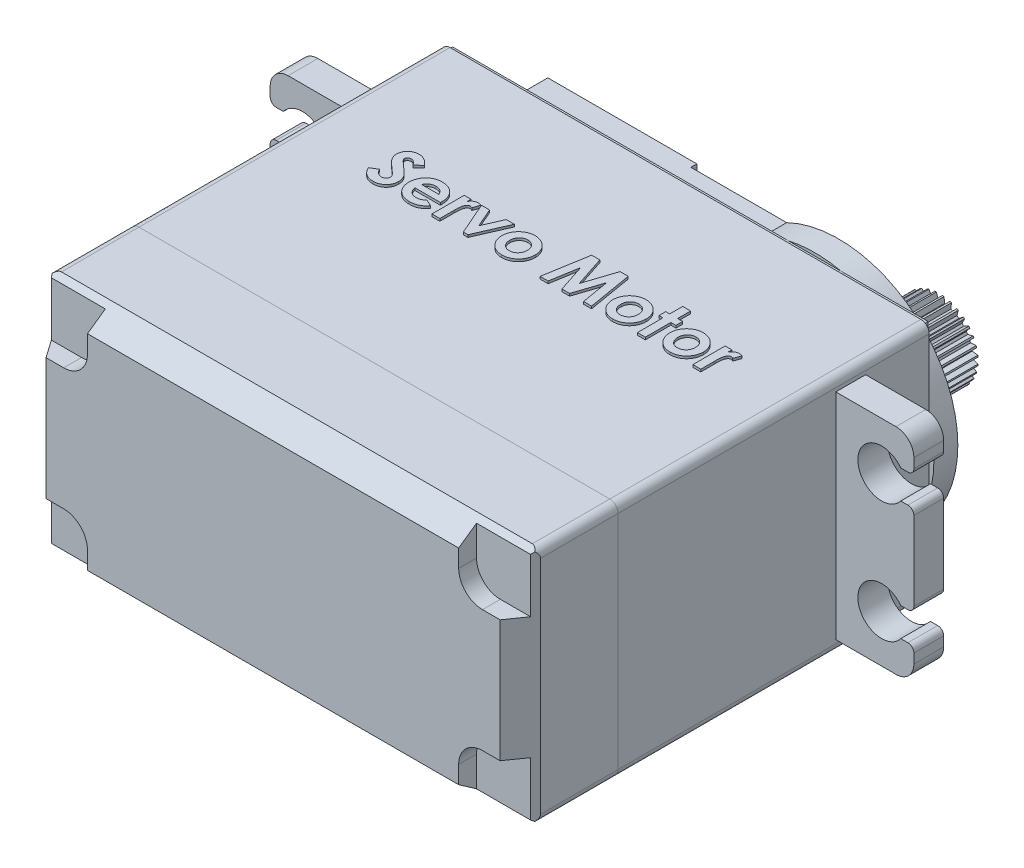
from build123d import *
from OCP.BRepFilletAPI import BRepFilletAPI_MakeChamfer

# Parameters (mm, degrees)
SKETCH1_W            = 40.9
SKETCH1_H            = 20
BOSS_EXTRUDE1_DEPTH  = 19.3
SKETCH2_W            = 40.9
SKETCH2_H            = 20
BOSS_EXTRUDE2_DEPTH  = 6.8
SKETCH3_W            = 40.9
SKETCH3_H            = 20
BOSS_EXTRUDE3_DEPTH  = 8.5
CHAMFER1_SIZE        = 2
CHAMFER1_SIZE2       = 1.400415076
CUT_EXTRUDE1_DEPTH   = 1.5
SKETCH5_W            = 39.9
SKETCH5_H            = 19.5
BOSS_EXTRUDE4_DEPTH  = 0.4
BOSS_EXTRUDE5_DEPTH  = 2
SKETCH8_R            = 6.5
BOSS_EXTRUDE6_DEPTH  = 1.5
SKETCH9_R            = 5.5
BOSS_EXTRUDE7_DEPTH  = 0.5
SKETCH10_R           = 3.25
BOSS_EXTRUDE8_DEPTH  = 5
SKETCH11_W           = 10.5
SKETCH11_H           = 15.998933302
BOSS_EXTRUDE9_DEPTH  = 0.5
FILLET1_R            = 0.7
FILLET2_R            = 0.7
FILLET3_R            = 0.7
BOSS_EXTRUDE10_START = -5.74
BOSS_EXTRUDE10_DEPTH = 2.5
BOSS_EXTRUDE11_START = -20
BOSS_EXTRUDE11_DEPTH = 0.2
BOSS_EXTRUDE12_DEPTH = 0.2
CUT_EXTRUDE2_START   = -5
CUT_EXTRUDE2_DEPTH   = 5
CIRPATTERN3_COUNT    = 32


with BuildPart() as part:
    # Sketch1 → Boss-Extrude1 (new body)
    with BuildSketch(Plane.XY):
        Rectangle(SKETCH1_W, SKETCH1_H)
    extrude(amount=BOSS_EXTRUDE1_DEPTH)

    # Fillet1
    fillet1_edges = [part.edges().sort_by_distance(p)[0] for p in [
        (-20.45, 10, 9.65),
        (20.45, 10, 9.65),
        (20.45, -10, 9.65),
        (-20.45, -10, 9.65),
    ]]
    fillet(fillet1_edges, radius=FILLET1_R)



with BuildPart() as body_2:
    # Sketch2 → Boss-Extrude2 (new body)
    with BuildSketch(Plane(origin=(0, 0, 0), x_dir=(-1, 0, 0), z_dir=(0, 0, -1))):
        Rectangle(SKETCH2_W, SKETCH2_H)
    extrude(amount=BOSS_EXTRUDE2_DEPTH)

    # Sketch5 → Boss-Extrude4 (add)
    with BuildSketch(Plane(origin=(0, 0, -6.8), x_dir=(-1, 0, 0), z_dir=(0, 0, -1))):
        Rectangle(SKETCH5_W, SKETCH5_H)
    extrude(amount=BOSS_EXTRUDE4_DEPTH)

    # Sketch7 → Boss-Extrude5 (add)
    with BuildSketch(Plane(origin=(0, 0, -7.2), x_dir=(-1, 0, 0), z_dir=(0, 0, -1))):
        with BuildLine():
            Line((-6.09, 8.999466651), (14.45, 8.999466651))
            Line((14.45, 8.999466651), (14.45, 3.918790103))
            ThreePointArc((14.45, 3.918790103), (17.45, 0), (14.45, -3.918790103))
            Line((14.45, -3.918790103), (14.45, -8.999466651))
            Line((14.45, -8.999466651), (-6.09, -8.999466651))
            ThreePointArc((-6.09, -8.999466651), (-20.45, 0), (-6.09, 8.999466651))
        make_face()
    extrude(amount=BOSS_EXTRUDE5_DEPTH)

    # Sketch8 → Boss-Extrude6 (add)
    with BuildSketch(Plane(origin=(0, 0, -9.2), x_dir=(-1, 0, 0), z_dir=(0, 0, -1))):
        with Locations((-11.900165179, 0)):
            Circle(SKETCH8_R)
    extrude(amount=BOSS_EXTRUDE6_DEPTH)

    # Sketch9 → Boss-Extrude7 (add)
    with BuildSketch(Plane(origin=(0, 0, -10.7), x_dir=(-1, 0, 0), z_dir=(0, 0, -1))):
        with Locations((-11.900165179, 0)):
            Circle(SKETCH9_R)
    extrude(amount=BOSS_EXTRUDE7_DEPTH)

    # Sketch10 → Boss-Extrude8 (add)
    with BuildSketch(Plane(origin=(0, 0, -11.2), x_dir=(-1, 0, 0), z_dir=(0, 0, -1))):
        with Locations((-11.900165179, 0)):
            Circle(SKETCH10_R)
    extrude(amount=BOSS_EXTRUDE8_DEPTH)

    # Sketch11 → Boss-Extrude9 (add)
    with BuildSketch(Plane(origin=(0, 0, -9.2), x_dir=(-1, 0, 0), z_dir=(0, 0, -1))):
        with BuildLine():
            Line((14.45, 8.999466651), (1.95, 8.999466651))
            Line((1.95, 8.999466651), (1.95, 1.75))
            ThreePointArc((1.95, 1.75), (0.2, 0), (1.95, -1.75))
            Line((1.95, -1.75), (1.95, -8.999466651))
            Line((1.95, -8.999466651), (14.45, -8.999466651))
            Line((14.45, -8.999466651), (14.45, 8.999466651))
        make_face()
        with Locations((8.2, 0)):
            Rectangle(SKETCH11_W, SKETCH11_H, mode=Mode.SUBTRACT)
    extrude(amount=BOSS_EXTRUDE9_DEPTH)

    # Fillet2
    fillet2_edges = [body_2.edges().sort_by_distance(p)[0] for p in [
        (20.45, -10, -3.4),
        (20.45, 10, -3.4),
        (-20.45, 10, -3.4),
        (-20.45, -10, -3.4),
    ]]
    fillet(fillet2_edges, radius=FILLET2_R)


with BuildPart() as body_3:
    # Sketch3 → Boss-Extrude3 (new body)
    with BuildSketch(Plane.XY.offset(19.3)):
        Rectangle(SKETCH3_W, SKETCH3_H)
    extrude(amount=BOSS_EXTRUDE3_DEPTH)

    # Chamfer1: one chamfer whose edges measure the first distance from different faces: ONE call of the kernel's chamfer builder (chamfer() names one face for all edges)
    chamfer1_edges_1 = [body_3.edges().sort_by_distance(p)[0] for p in [
        (0, -10, 27.8),
    ]]
    chamfer1_side_1 = [body_3.faces().sort_by_distance(p)[0] for p in [
        (0, -10, 23.55),
    ]]
    chamfer1_edges_2 = [body_3.edges().sort_by_distance(p)[0] for p in [
        (20.45, 0, 27.8),
    ]]
    chamfer1_side_2 = [body_3.faces().sort_by_distance(p)[0] for p in [
        (20.45, 0, 23.55),
    ]]
    chamfer1_edges_3 = [body_3.edges().sort_by_distance(p)[0] for p in [
        (0, 10, 27.8),
    ]]
    chamfer1_side_3 = [body_3.faces().sort_by_distance(p)[0] for p in [
        (0, 10, 23.55),
    ]]
    chamfer1_edges_4 = [body_3.edges().sort_by_distance(p)[0] for p in [
        (-20.45, 0, 27.8),
    ]]
    chamfer1_side_4 = [body_3.faces().sort_by_distance(p)[0] for p in [
        (-20.45, 0, 23.55),
    ]]
    chamfer1 = BRepFilletAPI_MakeChamfer(body_3.part.solid().wrapped)
    for e in chamfer1_edges_1:
        chamfer1.Add(CHAMFER1_SIZE, CHAMFER1_SIZE2, e.wrapped, chamfer1_side_1[0].wrapped)  # the first distance lies on this face
    for e in chamfer1_edges_2:
        chamfer1.Add(CHAMFER1_SIZE, CHAMFER1_SIZE2, e.wrapped, chamfer1_side_2[0].wrapped)  # the first distance lies on this face
    for e in chamfer1_edges_3:
        chamfer1.Add(CHAMFER1_SIZE, CHAMFER1_SIZE2, e.wrapped, chamfer1_side_3[0].wrapped)  # the first distance lies on this face
    for e in chamfer1_edges_4:
        chamfer1.Add(CHAMFER1_SIZE, CHAMFER1_SIZE2, e.wrapped, chamfer1_side_4[0].wrapped)  # the first distance lies on this face
    add(Compound.cast(chamfer1.Shape()), mode=Mode.REPLACE)

    # Sketch4 → Cut-Extrude1 (cut)
    with BuildSketch(Plane.XY.offset(27.8)):
        with BuildLine():
            Line((-20.45, 10), (-15.57, 10))
            Line((-15.57, 10), (-15.57, 7.12))
            ThreePointArc((-15.57, 7.12), (-16.155786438, 5.705786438), (-17.57, 5.12))
            Line((-17.57, 5.12), (-20.45, 5.12))
            Line((-20.45, 5.12), (-20.45, 10))
        make_face()
        with BuildLine():
            Line((15.57, 10), (15.57, 7.12))
            ThreePointArc((15.57, 7.12), (16.155786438, 5.705786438), (17.57, 5.12))
            Line((17.57, 5.12), (20.45, 5.12))
            Line((20.45, 5.12), (20.45, 10))
            Line((20.45, 10), (15.57, 10))
        make_face()
        with BuildLine():
            Line((-15.57, -10), (-15.57, -7.12))
            ThreePointArc((-15.57, -7.12), (-16.155786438, -5.705786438), (-17.57, -5.12))
            Line((-17.57, -5.12), (-20.45, -5.12))
            Line((-20.45, -5.12), (-20.45, -10))
            Line((-20.45, -10), (-15.57, -10))
        make_face()
        with BuildLine():
            Line((20.45, -10), (15.57, -10))
            Line((15.57, -10), (15.57, -7.12))
            ThreePointArc((15.57, -7.12), (16.155786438, -5.705786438), (17.57, -5.12))
            Line((17.57, -5.12), (20.45, -5.12))
            Line((20.45, -5.12), (20.45, -10))
        make_face()
    extrude(amount=-CUT_EXTRUDE1_DEPTH, mode=Mode.SUBTRACT)

    # Fillet3
    fillet3_edges = [body_3.edges().sort_by_distance(p)[0] for p in [
        (20.45, 10, 22.55),
        (20.45, -10, 22.55),
        (-20.45, -10, 22.55),
        (-20.45, 10, 22.55),
    ]]
    fillet(fillet3_edges, radius=FILLET3_R)


with BuildPart() as part_1:
    add(part.part)

    add(body_2.part)  # Boss-Extrude10 merges body 2
    # Sketch12 → Boss-Extrude10 (add)
    with BuildSketch(Plane(origin=(0, 0, -7.2), x_dir=(-1, 0, 0), z_dir=(0, 0, -1)).offset(BOSS_EXTRUDE10_START)):
        with BuildLine():
            Line((20.45, 9), (25.5, 9))
            ThreePointArc((25.5, 9), (26.560660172, 8.560660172), (27, 7.5))
            Line((27, 7.5), (27, 6.7))
            ThreePointArc((27, 6.7), (26.853553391, 6.346446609), (26.5, 6.2))
            Line((26.5, 6.2), (25.9, 6.2))
            ThreePointArc((25.9, 6.2), (22.3, 5), (25.9, 3.8))
            Line((25.9, 3.8), (26.5, 3.8))
            ThreePointArc((26.5, 3.8), (26.853553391, 3.653553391), (27, 3.3))
            Line((27, 3.3), (27, -3.3))
            ThreePointArc((27, -3.3), (26.853553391, -3.653553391), (26.5, -3.8))
            Line((26.5, -3.8), (25.9, -3.8))
            ThreePointArc((25.9, -3.8), (22.3, -5), (25.9, -6.2))
            Line((25.9, -6.2), (26.5, -6.2))
            ThreePointArc((26.5, -6.2), (26.853553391, -6.346446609), (27, -6.7))
            Line((27, -6.7), (27, -7.5))
            ThreePointArc((27, -7.5), (26.560660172, -8.560660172), (25.5, -9))
            Line((25.5, -9), (20.45, -9))
            Line((20.45, -9), (20.45, 9))
        make_face()
    boss_extrude10 = extrude(amount=-BOSS_EXTRUDE10_DEPTH)

    # Mirror1: Boss-Extrude10 across plane
    add(boss_extrude10.mirror(Plane(origin=(0, 0, 0), x_dir=(0, 0, 1), z_dir=(1, 0, 0))))

    # Sketch13 → Boss-Extrude11 (add)
    # profile 1 of 10: a face of its own
    with BuildSketch(Plane.XZ.offset(10).offset(BOSS_EXTRUDE11_START)):
        with BuildLine():
            Line((-12.068456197, 3.040761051), (-12.565609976, 3.495619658))
            add(Edge.make_bspline(
                [(-12.565609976, 3.495619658), (-12.586901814, 3.46557416), (-12.627779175, 3.407890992), (-12.694103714, 3.33073619), (-12.760032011, 3.26448562), (-12.826912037, 3.211033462), (-12.893592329, 3.168002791), (-12.961489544, 3.138322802), (-13.029822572, 3.119235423), (-13.075755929, 3.116870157), (-13.098380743, 3.115705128)],
                knots=[0, 0, 0, 0, 1.299459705, 2.494781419, 3.587730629, 4.594196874, 5.512431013, 6.380462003, 7.202284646, 8, 8, 8, 8], degree=3))
            add(Edge.make_bspline(
                [(-13.098380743, 3.115705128), (-13.119493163, 3.11642317), (-13.160255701, 3.117809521), (-13.218095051, 3.132283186), (-13.270073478, 3.155671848), (-13.314806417, 3.187979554), (-13.350793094, 3.22656433), (-13.378774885, 3.267639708), (-13.395035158, 3.312425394), (-13.397123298, 3.343140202), (-13.398157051, 3.358345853)],
                knots=[0, 0, 0, 0, 1.184157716, 2.286297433, 3.324836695, 4.370048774, 5.362957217, 6.276446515, 7.146738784, 8, 8, 8, 8], degree=3))
            add(Edge.make_bspline(
                [(-13.398157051, 3.358345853), (-13.397502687, 3.37376364), (-13.396184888, 3.40481292), (-13.383456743, 3.450319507), (-13.364271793, 3.49478474), (-13.345939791, 3.521852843), (-13.336569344, 3.535688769)],
                knots=[0, 0, 0, 0, 0.967525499, 1.948461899, 2.951351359, 4, 4, 4, 4], degree=3))
            add(Edge.make_bspline(
                [(-13.336569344, 3.535688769), (-13.328016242, 3.546411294), (-13.308214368, 3.571235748), (-13.271603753, 3.611181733), (-13.223733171, 3.658076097), (-13.166625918, 3.714281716), (-13.098138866, 3.777615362), (-13.019742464, 3.84991079), (-12.929692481, 3.928712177), (-12.866603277, 3.984342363), (-12.8334794, 4.013550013)],
                knots=[0, 0, 0, 0, 0.473849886, 1.097042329, 1.870584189, 2.789244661, 3.865562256, 5.093556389, 6.47402294, 8, 8, 8, 8], degree=3))
            add(Edge.make_bspline(
                [(-12.8334794, 4.013550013), (-12.802313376, 4.040508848), (-12.743166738, 4.091671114), (-12.659119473, 4.164407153), (-12.584775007, 4.229552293), (-12.520809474, 4.287594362), (-12.465311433, 4.336143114), (-12.420735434, 4.378185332), (-12.385173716, 4.411881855), (-12.364978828, 4.432257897), (-12.356360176, 4.44095386)],
                knots=[0, 0, 0, 0, 1.543627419, 2.929484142, 4.163674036, 5.24627963, 6.164986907, 6.925413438, 7.541394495, 8, 8, 8, 8], degree=3))
            add(Edge.make_bspline(
                [(-12.356360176, 4.44095386), (-12.323642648, 4.476333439), (-12.260748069, 4.544345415), (-12.179167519, 4.650027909), (-12.111300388, 4.752398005), (-12.058744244, 4.854346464), (-12.020628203, 4.957980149), (-11.992881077, 5.064777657), (-11.976249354, 5.176265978), (-11.974408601, 5.252173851), (-11.973477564, 5.290567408)],
                knots=[0, 0, 0, 0, 1.206413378, 2.319150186, 3.339784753, 4.27899982, 5.184598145, 6.099639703, 7.038813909, 8, 8, 8, 8], degree=3))
            add(Edge.make_bspline(
                [(-11.973477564, 5.290567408), (-11.974141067, 5.327977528), (-11.975442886, 5.401377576), (-11.991370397, 5.508792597), (-12.014114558, 5.611574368), (-12.049160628, 5.708693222), (-12.092235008, 5.801300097), (-12.144732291, 5.889426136), (-12.208915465, 5.971013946), (-12.280204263, 6.048264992), (-12.360289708, 6.117605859), (-12.446407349, 6.178738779), (-12.538721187, 6.230354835), (-12.636527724, 6.272891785), (-12.741053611, 6.304458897), (-12.850647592, 6.328325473), (-12.966413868, 6.342715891), (-13.045409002, 6.344213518), (-13.085766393, 6.344978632)],
                knots=[0, 0, 0, 0, 1.043039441, 2.046482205, 3.024244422, 3.976033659, 4.920890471, 5.871402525, 6.830893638, 7.812473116, 8.800703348, 9.781190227, 10.754606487, 11.746997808, 12.751247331, 13.796362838, 14.874195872, 16, 16, 16, 16], degree=3))
            add(Edge.make_bspline(
                [(-13.085766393, 6.344978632), (-13.117447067, 6.344417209), (-13.18019297, 6.343305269), (-13.272666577, 6.334208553), (-13.361977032, 6.319573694), (-13.447945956, 6.298435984), (-13.531117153, 6.272263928), (-13.610588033, 6.238230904), (-13.687415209, 6.199744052), (-13.761343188, 6.155144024), (-13.831759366, 6.10334542), (-13.900692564, 6.046392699), (-13.965699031, 5.981162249), (-14.029262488, 5.910032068), (-14.08872821, 5.830940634), (-14.147229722, 5.746267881), (-14.201911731, 5.653989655), (-14.235704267, 5.589268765), (-14.252964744, 5.556210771)],
                knots=[0, 0, 0, 0, 1.017088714, 2.014418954, 2.980620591, 3.920647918, 4.854987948, 5.776890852, 6.693269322, 7.612671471, 8.545186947, 9.498010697, 10.480815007, 11.499174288, 12.558697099, 13.655746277, 14.802607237, 16, 16, 16, 16], degree=3))
            Line((-14.252964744, 5.556210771), (-13.668252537, 5.205235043))
            add(Edge.make_bspline(
                [(-13.668252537, 5.205235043), (-13.646663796, 5.242761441), (-13.605276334, 5.314702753), (-13.53514141, 5.411365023), (-13.463291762, 5.494140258), (-13.388066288, 5.561565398), (-13.310379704, 5.614542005), (-13.229856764, 5.652402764), (-13.146440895, 5.675838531), (-13.089621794, 5.678700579), (-13.061279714, 5.680128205)],
                knots=[0, 0, 0, 0, 1.283663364, 2.460892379, 3.537111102, 4.529833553, 5.449777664, 6.316464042, 7.160231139, 8, 8, 8, 8], degree=3))
            add(Edge.make_bspline(
                [(-13.061279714, 5.680128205), (-13.032446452, 5.678973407), (-12.976505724, 5.676732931), (-12.896526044, 5.655629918), (-12.822876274, 5.623239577), (-12.759556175, 5.576132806), (-12.705785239, 5.522417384), (-12.667237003, 5.461834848), (-12.64223211, 5.397072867), (-12.63963446, 5.351881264), (-12.638327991, 5.329152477)],
                knots=[0, 0, 0, 0, 1.13537643, 2.202795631, 3.242191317, 4.290390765, 5.297919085, 6.223733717, 7.106639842, 8, 8, 8, 8], degree=3))
            add(Edge.make_bspline(
                [(-12.638327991, 5.329152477), (-12.639550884, 5.308017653), (-12.642035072, 5.26508428), (-12.660233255, 5.201212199), (-12.688921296, 5.137649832), (-12.721844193, 5.084962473), (-12.756168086, 5.041045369), (-12.789812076, 5.003565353), (-12.829686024, 4.961290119), (-12.876805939, 4.915372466), (-12.930255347, 4.864929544), (-12.99020923, 4.810081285), (-13.057313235, 4.751274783), (-13.104744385, 4.711218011), (-13.129545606, 4.69027277)],
                knots=[0, 0, 0, 0, 0.916057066, 1.860882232, 2.859899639, 3.934694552, 4.546382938, 5.276161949, 6.118633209, 7.067046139, 8.129668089, 9.306861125, 10.591787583, 12, 12, 12, 12], degree=3))
            add(Edge.make_bspline(
                [(-13.129545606, 4.69027277), (-13.17669195, 4.650379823), (-13.267180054, 4.573813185), (-13.395074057, 4.46074906), (-13.510237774, 4.355001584), (-13.611903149, 4.255724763), (-13.700372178, 4.163552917), (-13.776618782, 4.079295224), (-13.839410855, 4.001299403), (-13.904522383, 3.90814263), (-13.968138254, 3.796225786), (-14.022202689, 3.660944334), (-14.057143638, 3.525832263), (-14.061073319, 3.434973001), (-14.063007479, 3.390252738)],
                knots=[0, 0, 0, 0, 1.345685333, 2.582777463, 3.719355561, 4.752181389, 5.678433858, 6.502864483, 7.227563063, 7.858499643, 8.978226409, 10.023061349, 11.026965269, 12, 12, 12, 12], degree=3))
            add(Edge.make_bspline(
                [(-14.063007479, 3.390252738), (-14.062202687, 3.358540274), (-14.06061716, 3.296063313), (-14.046515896, 3.204189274), (-14.025343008, 3.115580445), (-13.994916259, 3.030259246), (-13.954105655, 2.949186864), (-13.905900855, 2.871051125), (-13.848929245, 2.796090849), (-13.783633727, 2.725968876), (-13.711957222, 2.661509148), (-13.635507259, 2.604955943), (-13.554990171, 2.557134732), (-13.470161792, 2.518176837), (-13.381172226, 2.48777608), (-13.287939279, 2.466291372), (-13.190748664, 2.453479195), (-13.124637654, 2.451740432), (-13.090960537, 2.450854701)],
                knots=[0, 0, 0, 0, 1.010806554, 1.991397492, 2.957573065, 3.913225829, 4.872777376, 5.846906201, 6.837692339, 7.870332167, 8.898170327, 9.907899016, 10.8981826, 11.879407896, 12.8797257, 13.891947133, 14.926152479, 16, 16, 16, 16], degree=3))
            add(Edge.make_bspline(
                [(-13.090960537, 2.450854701), (-13.047319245, 2.45245554), (-12.96038115, 2.455644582), (-12.831802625, 2.480451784), (-12.706150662, 2.519875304), (-12.604584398, 2.56631444), (-12.524465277, 2.612734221), (-12.462912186, 2.654604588), (-12.399790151, 2.702686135), (-12.336257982, 2.758378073), (-12.269906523, 2.818461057), (-12.204087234, 2.887058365), (-12.135577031, 2.960655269), (-12.091221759, 3.013591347), (-12.068456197, 3.040761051)],
                knots=[0, 0, 0, 0, 1.282890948, 2.555655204, 3.837225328, 5.149160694, 5.83044799, 6.558852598, 7.337307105, 8.162686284, 9.043076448, 9.969084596, 10.957622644, 12, 12, 12, 12], degree=3))
        make_face()
    # profile 2 of 10: a face of its own
    with BuildSketch(Plane.XZ.offset(10).offset(BOSS_EXTRUDE11_START)):
        with BuildLine():
            Line((-8.698940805, 5.062767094), (-10.833733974, 5.062767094))
            add(Edge.make_bspline(
                [(-10.833733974, 5.062767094), (-10.829370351, 5.087568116), (-10.820795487, 5.13630408), (-10.802435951, 5.206940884), (-10.778201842, 5.273459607), (-10.750330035, 5.336406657), (-10.717715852, 5.395559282), (-10.679204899, 5.450128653), (-10.63647524, 5.501237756), (-10.58871739, 5.548139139), (-10.53715488, 5.590288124), (-10.481647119, 5.626930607), (-10.42309824, 5.658208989), (-10.360839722, 5.683453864), (-10.295370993, 5.70370356), (-10.226257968, 5.717597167), (-10.153747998, 5.725822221), (-10.104349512, 5.72701025), (-10.079099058, 5.727617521)],
                knots=[0, 0, 0, 0, 1.091578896, 2.145038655, 3.15928737, 4.157766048, 5.127497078, 6.082469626, 7.049112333, 8.012179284, 8.980248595, 9.932024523, 10.891502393, 11.853374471, 12.840501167, 13.858428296, 14.905317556, 16, 16, 16, 16], degree=3))
            add(Edge.make_bspline(
                [(-10.079099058, 5.727617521), (-10.048620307, 5.726812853), (-9.98859867, 5.725228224), (-9.900666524, 5.711174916), (-9.81562333, 5.689948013), (-9.734273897, 5.658381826), (-9.655675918, 5.619087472), (-9.581123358, 5.570131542), (-9.50932577, 5.512944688), (-9.465520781, 5.468865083), (-9.443187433, 5.446391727)],
                knots=[0, 0, 0, 0, 1.021034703, 2.010718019, 2.977989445, 3.954245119, 4.929443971, 5.918328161, 6.938689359, 8, 8, 8, 8], degree=3))
            Line((-9.443187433, 5.446391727), (-8.886672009, 5.711293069))
            add(Edge.make_bspline(
                [(-8.886672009, 5.711293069), (-8.904469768, 5.735485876), (-8.939649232, 5.783305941), (-8.996328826, 5.850759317), (-9.054740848, 5.914210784), (-9.116499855, 5.97221724), (-9.18106758, 6.024889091), (-9.248169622, 6.072461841), (-9.317443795, 6.115749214), (-9.389389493, 6.154602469), (-9.465083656, 6.187778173), (-9.54335103, 6.217836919), (-9.625676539, 6.241870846), (-9.710915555, 6.263161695), (-9.80001574, 6.278285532), (-9.892372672, 6.289467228), (-9.988223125, 6.296260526), (-10.053364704, 6.297074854), (-10.086519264, 6.297489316)],
                knots=[0, 0, 0, 0, 1.033499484, 2.042839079, 3.030732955, 4.00037446, 4.956353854, 5.896509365, 6.829584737, 7.766535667, 8.707846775, 9.672354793, 10.650035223, 11.657650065, 12.694754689, 13.758082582, 14.858950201, 16, 16, 16, 16], degree=3))
            add(Edge.make_bspline(
                [(-10.086519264, 6.297489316), (-10.137527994, 6.296449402), (-10.23742565, 6.294412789), (-10.383544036, 6.27551011), (-10.522315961, 6.244167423), (-10.654133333, 6.201561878), (-10.778426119, 6.145309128), (-10.895256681, 6.076507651), (-11.005789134, 5.996475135), (-11.106658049, 5.90353713), (-11.198517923, 5.802364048), (-11.279328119, 5.693768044), (-11.346542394, 5.578156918), (-11.403387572, 5.457411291), (-11.445060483, 5.329284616), (-11.476515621, 5.195598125), (-11.495458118, 5.055393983), (-11.497530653, 4.95993137), (-11.498584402, 4.911394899)],
                knots=[0, 0, 0, 0, 1.103528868, 2.161197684, 3.181904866, 4.17893931, 5.15400521, 6.128071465, 7.108807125, 8.101535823, 9.090664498, 10.062772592, 11.024896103, 11.980490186, 12.945349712, 13.934753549, 14.949957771, 16, 16, 16, 16], degree=3))
            add(Edge.make_bspline(
                [(-11.498584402, 4.911394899), (-11.497528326, 4.861622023), (-11.495450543, 4.763696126), (-11.476589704, 4.620297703), (-11.445281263, 4.483462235), (-11.401979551, 4.353066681), (-11.347562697, 4.22834938), (-11.278140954, 4.11141713), (-11.197894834, 4.000437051), (-11.106266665, 3.89693111), (-11.004993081, 3.80346772), (-10.89737504, 3.720143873), (-10.782332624, 3.650978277), (-10.661342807, 3.594499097), (-10.534593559, 3.549152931), (-10.400780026, 3.518795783), (-10.261024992, 3.498449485), (-10.165495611, 3.496573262), (-10.116942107, 3.495619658)],
                knots=[0, 0, 0, 0, 1.079354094, 2.123580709, 3.131027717, 4.120248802, 5.100347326, 6.076737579, 7.064152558, 8.067633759, 9.069995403, 10.049814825, 11.015114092, 11.975254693, 12.94256508, 13.929104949, 14.947452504, 16, 16, 16, 16], degree=3))
            add(Edge.make_bspline(
                [(-10.116942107, 3.495619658), (-10.065687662, 3.496672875), (-9.965054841, 3.498740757), (-9.817937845, 3.51752995), (-9.67817591, 3.548919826), (-9.545458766, 3.591713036), (-9.420039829, 3.647622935), (-9.302360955, 3.716369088), (-9.191735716, 3.796909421), (-9.089690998, 3.889615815), (-8.997347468, 3.992198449), (-8.91614491, 4.103533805), (-8.848901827, 4.223711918), (-8.79275139, 4.351046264), (-8.749803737, 4.486466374), (-8.718665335, 4.629496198), (-8.699768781, 4.780786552), (-8.697748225, 4.884379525), (-8.696714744, 4.937365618)],
                knots=[0, 0, 0, 0, 1.079725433, 2.119929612, 3.118887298, 4.094664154, 5.053604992, 6.006563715, 6.961515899, 7.932002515, 8.906358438, 9.865525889, 10.829453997, 11.80269401, 12.793349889, 13.817750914, 14.883815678, 16, 16, 16, 16], degree=3))
            Line((-8.696714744, 4.937365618), (-8.698940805, 5.062767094))
        make_face()
        with BuildLine():
            add(Edge.make_bspline(
                [(-9.361565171, 4.540384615), (-9.373986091, 4.506443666), (-9.398654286, 4.439036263), (-9.456804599, 4.347444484), (-9.529772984, 4.265562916), (-9.617283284, 4.194850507), (-9.716302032, 4.136594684), (-9.825436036, 4.096228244), (-9.941541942, 4.069624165), (-10.021812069, 4.066887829), (-10.062774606, 4.065491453)],
                knots=[0, 0, 0, 0, 0.954548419, 1.89575218, 2.851198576, 3.847292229, 4.862571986, 5.878062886, 6.917157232, 8, 8, 8, 8], degree=3))
            add(Edge.make_bspline(
                [(-10.062774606, 4.065491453), (-10.107448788, 4.06735788), (-10.194707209, 4.07100342), (-10.321251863, 4.0992477), (-10.439464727, 4.145644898), (-10.509885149, 4.191148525), (-10.545087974, 4.213895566)],
                knots=[0, 0, 0, 0, 1.045043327, 2.041197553, 3.020804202, 4, 4, 4, 4], degree=3))
            add(Edge.make_bspline(
                [(-10.545087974, 4.213895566), (-10.567048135, 4.231494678), (-10.614014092, 4.269133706), (-10.673952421, 4.344710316), (-10.734512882, 4.434925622), (-10.7682902, 4.503783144), (-10.786244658, 4.540384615)],
                knots=[0, 0, 0, 0, 0.821695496, 1.757351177, 2.807911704, 4, 4, 4, 4], degree=3))
            Line((-10.786244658, 4.540384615), (-9.361565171, 4.540384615))
        make_face(mode=Mode.SUBTRACT)
    # profile 3 of 10: a face of its own
    with BuildSketch(Plane.XZ.offset(10).offset(BOSS_EXTRUDE11_START)):
        with BuildLine():
            Line((-8.221821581, 3.543108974), (-7.651949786, 3.543108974))
            Line((-7.651949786, 3.543108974), (-7.651949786, 3.876276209))
            add(Edge.make_bspline(
                [(-7.651949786, 3.876276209), (-7.635845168, 3.846650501), (-7.604368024, 3.788745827), (-7.54615723, 3.711162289), (-7.48016195, 3.644651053), (-7.406497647, 3.590733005), (-7.327677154, 3.547862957), (-7.244174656, 3.518460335), (-7.157451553, 3.498658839), (-7.098018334, 3.496640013), (-7.067979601, 3.495619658)],
                knots=[0, 0, 0, 0, 1.098409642, 2.146887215, 3.15060926, 4.142663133, 5.113340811, 6.064933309, 7.021978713, 8, 8, 8, 8], degree=3))
            add(Edge.make_bspline(
                [(-7.067979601, 3.495619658), (-7.04615232, 3.496547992), (-7.001659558, 3.498440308), (-6.934310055, 3.512023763), (-6.865258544, 3.532374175), (-6.820198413, 3.552237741), (-6.797142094, 3.562401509)],
                knots=[0, 0, 0, 0, 0.931681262, 1.899140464, 2.92503444, 4, 4, 4, 4], degree=3))
            Line((-6.797142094, 3.562401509), (-7.003423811, 4.125595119))
            add(Edge.make_bspline(
                [(-7.003423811, 4.125595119), (-7.021862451, 4.11668646), (-7.056519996, 4.09994161), (-7.106836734, 4.080180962), (-7.152501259, 4.06812398), (-7.18145173, 4.066324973), (-7.194865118, 4.065491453)],
                knots=[0, 0, 0, 0, 1.214386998, 2.282580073, 3.20428172, 4, 4, 4, 4], degree=3))
            add(Edge.make_bspline(
                [(-7.194865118, 4.065491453), (-7.207533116, 4.066039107), (-7.232453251, 4.067116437), (-7.269179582, 4.076495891), (-7.304114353, 4.092337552), (-7.337516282, 4.113985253), (-7.369305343, 4.14154463), (-7.399918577, 4.174839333), (-7.427290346, 4.215615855), (-7.456076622, 4.261134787), (-7.480595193, 4.316808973), (-7.501698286, 4.383272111), (-7.520104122, 4.461392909), (-7.534542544, 4.551174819), (-7.545337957, 4.65250327), (-7.553277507, 4.765363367), (-7.558647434, 4.889824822), (-7.559008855, 4.976686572), (-7.559197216, 5.021955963)],
                knots=[0, 0, 0, 0, 0.544259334, 1.070651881, 1.618331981, 2.187895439, 2.776420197, 3.424094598, 4.12659612, 4.885633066, 5.737955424, 6.733832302, 7.882163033, 9.186958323, 10.642647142, 12.264016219, 14.052932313, 16, 16, 16, 16], degree=3))
            Line((-7.559197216, 5.021955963), (-7.556971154, 5.154035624))
            Line((-7.556971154, 5.154035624), (-7.556971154, 6.25))
            Line((-7.556971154, 6.25), (-8.221821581, 6.25))
            Line((-8.221821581, 6.25), (-8.221821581, 3.543108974))
        make_face()
    # profile 4 of 10: a face of its own
    with BuildSketch(Plane.XZ.offset(10).offset(BOSS_EXTRUDE11_START)):
        Polygon((-6.773397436, 3.543108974), (-6.096674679, 3.543108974), (-5.396207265, 5.140679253), (-4.697965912, 3.543108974), (-4.019017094, 3.543108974), (-5.204023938, 6.25), (-5.587648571, 6.25), align=None)
    # profile 5 of 10: a face of its own
    with BuildSketch(Plane.XZ.offset(10).offset(BOSS_EXTRUDE11_START)):
        with BuildLine():
            add(Edge.make_bspline(
                [(-2.325726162, 3.495619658), (-2.294291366, 3.496171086), (-2.232036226, 3.497263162), (-2.139349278, 3.506600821), (-2.048092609, 3.521215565), (-1.958282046, 3.54238347), (-1.869470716, 3.567877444), (-1.782865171, 3.601173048), (-1.696931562, 3.638625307), (-1.613868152, 3.683393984), (-1.53305018, 3.731940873), (-1.456481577, 3.785243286), (-1.385003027, 3.84374759), (-1.317472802, 3.905597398), (-1.255180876, 3.972374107), (-1.195774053, 4.041836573), (-1.142891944, 4.117164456), (-1.09381441, 4.195546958), (-1.05026919, 4.276894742), (-1.012105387, 4.360326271), (-0.9803718, 4.445462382), (-0.954352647, 4.532257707), (-0.933113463, 4.620328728), (-0.919638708, 4.710490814), (-0.910079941, 4.801866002), (-0.909006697, 4.863385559), (-0.90846688, 4.894328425)],
                knots=[0, 0, 0, 0, 1.022244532, 2.024507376, 3.027060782, 4.026251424, 5.024178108, 6.029825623, 7.041920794, 8.071232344, 9.096385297, 10.107424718, 11.10255854, 12.098894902, 13.083468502, 14.071323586, 15.06921784, 16.07380283, 17.078033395, 18.068113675, 19.055870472, 20.030666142, 21.014187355, 21.99958235, 22.993837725, 24, 24, 24, 24], degree=3))
            add(Edge.make_bspline(
                [(-0.90846688, 4.894328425), (-0.90903686, 4.925512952), (-0.910170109, 4.987514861), (-0.919288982, 5.079750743), (-0.934430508, 5.170332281), (-0.953791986, 5.259637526), (-0.981489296, 5.346706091), (-1.01254786, 5.433004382), (-1.052112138, 5.516914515), (-1.095278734, 5.599747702), (-1.143869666, 5.67949947), (-1.197798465, 5.754838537), (-1.255595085, 5.825903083), (-1.31706252, 5.893078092), (-1.383529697, 5.954828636), (-1.45440759, 6.012027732), (-1.528990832, 6.065447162), (-1.607840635, 6.113814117), (-1.689940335, 6.156313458), (-1.77390715, 6.194629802), (-1.860231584, 6.226530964), (-1.948735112, 6.252545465), (-2.039471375, 6.272687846), (-2.132240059, 6.286370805), (-2.226841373, 6.295887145), (-2.290580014, 6.296951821), (-2.32275808, 6.297489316)],
                knots=[0, 0, 0, 0, 1.012065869, 2.012216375, 3.004733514, 3.992205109, 4.97496602, 5.968164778, 6.966799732, 7.983091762, 8.999225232, 9.995016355, 10.988052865, 11.970944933, 12.947950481, 13.92969433, 14.925485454, 15.92373309, 16.929186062, 17.924491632, 18.917690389, 19.913513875, 20.91665649, 21.931711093, 22.955836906, 24, 24, 24, 24], degree=3))
            add(Edge.make_bspline(
                [(-2.32275808, 6.297489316), (-2.369808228, 6.296106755), (-2.462544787, 6.293381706), (-2.599136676, 6.274758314), (-2.730306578, 6.242583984), (-2.856604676, 6.198109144), (-2.976899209, 6.139748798), (-3.092360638, 6.0693911), (-3.202190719, 5.986072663), (-3.305200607, 5.89081907), (-3.39940294, 5.786925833), (-3.483445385, 5.677098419), (-3.553242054, 5.560603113), (-3.610989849, 5.438928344), (-3.655458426, 5.311512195), (-3.687598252, 5.178851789), (-3.706264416, 5.040542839), (-3.708963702, 4.946572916), (-3.710336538, 4.898780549)],
                knots=[0, 0, 0, 0, 1.030165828, 2.030472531, 3.01169893, 3.982950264, 4.956720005, 5.933857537, 6.939049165, 7.970068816, 9.001429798, 10.006621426, 10.993020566, 11.969347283, 12.950812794, 13.942564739, 14.953604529, 16, 16, 16, 16], degree=3))
            add(Edge.make_bspline(
                [(-3.710336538, 4.898780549), (-3.708915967, 4.847748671), (-3.706123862, 4.747446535), (-3.683953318, 4.600501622), (-3.648549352, 4.459808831), (-3.597729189, 4.325761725), (-3.532810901, 4.198113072), (-3.453560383, 4.077132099), (-3.359585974, 3.9627914), (-3.287620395, 3.893634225), (-3.251025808, 3.858467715)],
                knots=[0, 0, 0, 0, 1.043912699, 2.05178951, 3.033892, 4.007821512, 4.978932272, 5.95884105, 6.962068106, 8, 8, 8, 8], degree=3))
            add(Edge.make_bspline(
                [(-3.251025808, 3.858467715), (-3.217446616, 3.829318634), (-3.151201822, 3.77181353), (-3.043575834, 3.698877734), (-2.933378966, 3.635883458), (-2.819290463, 3.584090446), (-2.700992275, 3.545039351), (-2.579090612, 3.516613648), (-2.453610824, 3.499153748), (-2.368571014, 3.496803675), (-2.325726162, 3.495619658)],
                knots=[0, 0, 0, 0, 1.048115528, 2.067714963, 3.060638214, 4.039924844, 5.017819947, 5.994373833, 6.98952318, 8, 8, 8, 8], degree=3))
        make_face()
        with BuildLine():
            add(Edge.make_bspline(
                [(-2.310885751, 4.112980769), (-2.33663543, 4.113806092), (-2.387323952, 4.115430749), (-2.461733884, 4.124893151), (-2.532749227, 4.141843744), (-2.599763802, 4.166969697), (-2.664302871, 4.19719714), (-2.725153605, 4.235267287), (-2.782542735, 4.280319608), (-2.83674152, 4.331036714), (-2.884835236, 4.388147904), (-2.928919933, 4.448137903), (-2.96412201, 4.51346588), (-2.994170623, 4.58180532), (-3.017222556, 4.654201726), (-3.033225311, 4.730539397), (-3.04424251, 4.810407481), (-3.045067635, 4.86510405), (-3.045486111, 4.892844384)],
                knots=[0, 0, 0, 0, 1.030671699, 2.028888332, 2.996449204, 3.945347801, 4.88844585, 5.84434065, 6.810634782, 7.804966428, 8.808860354, 9.795028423, 10.778609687, 11.771659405, 12.779693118, 13.812596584, 14.890619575, 16, 16, 16, 16], degree=3))
            add(Edge.make_bspline(
                [(-3.045486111, 4.892844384), (-3.044999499, 4.921564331), (-3.044048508, 4.977691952), (-3.034191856, 5.059643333), (-3.017957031, 5.137424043), (-2.994826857, 5.210870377), (-2.966048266, 5.280465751), (-2.929945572, 5.345474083), (-2.8877108, 5.406626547), (-2.838610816, 5.462514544), (-2.785529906, 5.513775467), (-2.728433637, 5.558496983), (-2.667447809, 5.595755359), (-2.603667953, 5.627461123), (-2.535710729, 5.650829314), (-2.464744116, 5.668326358), (-2.390035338, 5.67768286), (-2.339105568, 5.679301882), (-2.313111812, 5.680128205)],
                knots=[0, 0, 0, 0, 1.142120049, 2.232054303, 3.278062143, 4.298865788, 5.291195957, 6.268928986, 7.251601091, 8.242075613, 9.223367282, 10.183915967, 11.12057987, 12.06234684, 13.011538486, 13.973346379, 14.965627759, 16, 16, 16, 16], degree=3))
            add(Edge.make_bspline(
                [(-2.313111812, 5.680128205), (-2.287104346, 5.679396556), (-2.236114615, 5.677962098), (-2.161328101, 5.667226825), (-2.089962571, 5.650314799), (-2.021661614, 5.626506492), (-1.95694499, 5.594970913), (-1.895191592, 5.557114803), (-1.836742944, 5.51234658), (-1.78320925, 5.460234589), (-1.733491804, 5.403974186), (-1.690914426, 5.342202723), (-1.654668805, 5.277090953), (-1.624366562, 5.20791084), (-1.601725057, 5.13464944), (-1.585552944, 5.05737774), (-1.574536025, 4.976514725), (-1.573728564, 4.921078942), (-1.573317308, 4.892844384)],
                knots=[0, 0, 0, 0, 1.031306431, 2.021959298, 2.990454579, 3.936832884, 4.884634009, 5.840373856, 6.805833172, 7.798087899, 8.799467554, 9.779227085, 10.767399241, 11.751618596, 12.769396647, 13.802707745, 14.880874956, 16, 16, 16, 16], degree=3))
            add(Edge.make_bspline(
                [(-1.573317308, 4.892844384), (-1.573810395, 4.864618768), (-1.574777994, 4.809230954), (-1.584631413, 4.72827168), (-1.600720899, 4.651433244), (-1.62409821, 4.579038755), (-1.652969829, 4.510280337), (-1.688563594, 4.445443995), (-1.731441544, 4.385225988), (-1.779147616, 4.328852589), (-1.832897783, 4.278410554), (-1.890393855, 4.233894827), (-1.951921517, 4.196442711), (-2.016840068, 4.165824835), (-2.085301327, 4.142224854), (-2.157279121, 4.1247184), (-2.232980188, 4.11547084), (-2.284645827, 4.113819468), (-2.310885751, 4.112980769)],
                knots=[0, 0, 0, 0, 1.123798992, 2.205258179, 3.242884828, 4.246127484, 5.230570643, 6.209477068, 7.185255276, 8.170486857, 9.146165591, 10.115657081, 11.061842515, 12.009360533, 12.968990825, 13.941530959, 14.954545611, 16, 16, 16, 16], degree=3))
        make_face(mode=Mode.SUBTRACT)
    # profile 6 of 10: a face of its own
    with BuildSketch(Plane.XZ.offset(10).offset(BOSS_EXTRUDE11_START)):
        Polygon((1.474161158, 2.545833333), (2.162756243, 2.545833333), (3.009401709, 5.129548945), (3.860499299, 2.545833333), (4.54390024, 2.545833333), (5.170165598, 6.25), (4.497152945, 6.25), (4.101655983, 3.910409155), (3.331438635, 6.25), (2.683654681, 6.25), (1.917147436, 3.910409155), (1.522392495, 6.25), (0.848637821, 6.25), align=None)
    # profile 7 of 10: a face of its own
    with BuildSketch(Plane.XZ.offset(10).offset(BOSS_EXTRUDE11_START)):
        with BuildLine():
            add(Edge.make_bspline(
                [(6.982179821, 3.495619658), (7.013614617, 3.496171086), (7.075869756, 3.497263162), (7.168556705, 3.506600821), (7.259813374, 3.521215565), (7.349623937, 3.54238347), (7.438435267, 3.567877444), (7.525040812, 3.601173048), (7.610974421, 3.638625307), (7.694037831, 3.683393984), (7.774855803, 3.731940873), (7.851424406, 3.785243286), (7.922902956, 3.84374759), (7.990433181, 3.905597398), (8.052725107, 3.972374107), (8.11213193, 4.041836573), (8.165014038, 4.117164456), (8.214091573, 4.195546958), (8.257636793, 4.276894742), (8.295800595, 4.360326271), (8.327534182, 4.445462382), (8.353553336, 4.532257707), (8.37479252, 4.620328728), (8.388267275, 4.710490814), (8.397826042, 4.801866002), (8.398899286, 4.863385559), (8.399439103, 4.894328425)],
                knots=[0, 0, 0, 0, 1.022244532, 2.024507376, 3.027060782, 4.026251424, 5.024178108, 6.029825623, 7.041920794, 8.071232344, 9.096385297, 10.107424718, 11.10255854, 12.098894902, 13.083468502, 14.071323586, 15.06921784, 16.07380283, 17.078033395, 18.068113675, 19.055870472, 20.030666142, 21.014187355, 21.99958235, 22.993837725, 24, 24, 24, 24], degree=3))
            add(Edge.make_bspline(
                [(8.399439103, 4.894328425), (8.398869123, 4.925512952), (8.397735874, 4.987514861), (8.388617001, 5.079750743), (8.373475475, 5.170332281), (8.354113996, 5.259637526), (8.326416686, 5.346706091), (8.295358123, 5.433004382), (8.255793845, 5.516914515), (8.212627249, 5.599747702), (8.164036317, 5.67949947), (8.110107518, 5.754838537), (8.052310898, 5.825903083), (7.990843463, 5.893078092), (7.924376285, 5.954828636), (7.853498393, 6.012027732), (7.778915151, 6.065447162), (7.700065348, 6.113814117), (7.617965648, 6.156313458), (7.533998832, 6.194629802), (7.447674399, 6.226530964), (7.359170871, 6.252545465), (7.268434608, 6.272687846), (7.175665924, 6.286370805), (7.081064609, 6.295887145), (7.017325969, 6.296951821), (6.985147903, 6.297489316)],
                knots=[0, 0, 0, 0, 1.012065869, 2.012216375, 3.004733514, 3.992205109, 4.97496602, 5.968164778, 6.966799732, 7.983091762, 8.999225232, 9.995016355, 10.988052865, 11.970944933, 12.947950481, 13.92969433, 14.925485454, 15.92373309, 16.929186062, 17.924491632, 18.917690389, 19.913513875, 20.91665649, 21.931711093, 22.955836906, 24, 24, 24, 24], degree=3))
            add(Edge.make_bspline(
                [(6.985147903, 6.297489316), (6.938097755, 6.296106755), (6.845361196, 6.293381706), (6.708769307, 6.274758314), (6.577599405, 6.242583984), (6.451301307, 6.198109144), (6.331006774, 6.139748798), (6.215545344, 6.0693911), (6.105715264, 5.986072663), (6.002705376, 5.89081907), (5.908503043, 5.786925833), (5.824460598, 5.677098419), (5.754663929, 5.560603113), (5.696916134, 5.438928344), (5.652447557, 5.311512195), (5.620307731, 5.178851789), (5.601641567, 5.040542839), (5.59894228, 4.946572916), (5.597569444, 4.898780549)],
                knots=[0, 0, 0, 0, 1.030165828, 2.030472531, 3.01169893, 3.982950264, 4.956720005, 5.933857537, 6.939049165, 7.970068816, 9.001429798, 10.006621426, 10.993020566, 11.969347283, 12.950812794, 13.942564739, 14.953604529, 16, 16, 16, 16], degree=3))
            add(Edge.make_bspline(
                [(5.597569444, 4.898780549), (5.598990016, 4.847748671), (5.601782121, 4.747446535), (5.623952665, 4.600501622), (5.659356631, 4.459808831), (5.710176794, 4.325761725), (5.775095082, 4.198113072), (5.8543456, 4.077132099), (5.948320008, 3.9627914), (6.020285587, 3.893634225), (6.056880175, 3.858467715)],
                knots=[0, 0, 0, 0, 1.043912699, 2.05178951, 3.033892, 4.007821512, 4.978932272, 5.95884105, 6.962068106, 8, 8, 8, 8], degree=3))
            add(Edge.make_bspline(
                [(6.056880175, 3.858467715), (6.090459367, 3.829318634), (6.156704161, 3.77181353), (6.264330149, 3.698877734), (6.374527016, 3.635883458), (6.48861552, 3.584090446), (6.606913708, 3.545039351), (6.72881537, 3.516613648), (6.854295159, 3.499153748), (6.939334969, 3.496803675), (6.982179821, 3.495619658)],
                knots=[0, 0, 0, 0, 1.048115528, 2.067714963, 3.060638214, 4.039924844, 5.017819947, 5.994373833, 6.98952318, 8, 8, 8, 8], degree=3))
        make_face()
        with BuildLine():
            add(Edge.make_bspline(
                [(6.997020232, 4.112980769), (6.971270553, 4.113806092), (6.920582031, 4.115430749), (6.846172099, 4.124893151), (6.775156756, 4.141843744), (6.708142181, 4.166969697), (6.643603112, 4.19719714), (6.582752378, 4.235267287), (6.525363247, 4.280319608), (6.471164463, 4.331036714), (6.423070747, 4.388147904), (6.37898605, 4.448137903), (6.343783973, 4.51346588), (6.31373536, 4.58180532), (6.290683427, 4.654201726), (6.274680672, 4.730539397), (6.263663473, 4.810407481), (6.262838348, 4.86510405), (6.262419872, 4.892844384)],
                knots=[0, 0, 0, 0, 1.030671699, 2.028888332, 2.996449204, 3.945347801, 4.88844585, 5.84434065, 6.810634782, 7.804966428, 8.808860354, 9.795028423, 10.778609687, 11.771659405, 12.779693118, 13.812596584, 14.890619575, 16, 16, 16, 16], degree=3))
            add(Edge.make_bspline(
                [(6.262419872, 4.892844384), (6.262906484, 4.921564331), (6.263857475, 4.977691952), (6.273714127, 5.059643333), (6.289948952, 5.137424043), (6.313079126, 5.210870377), (6.341857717, 5.280465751), (6.377960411, 5.345474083), (6.420195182, 5.406626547), (6.469295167, 5.462514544), (6.522376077, 5.513775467), (6.579472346, 5.558496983), (6.640458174, 5.595755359), (6.70423803, 5.627461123), (6.772195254, 5.650829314), (6.843161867, 5.668326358), (6.917870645, 5.67768286), (6.968800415, 5.679301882), (6.994794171, 5.680128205)],
                knots=[0, 0, 0, 0, 1.142120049, 2.232054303, 3.278062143, 4.298865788, 5.291195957, 6.268928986, 7.251601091, 8.242075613, 9.223367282, 10.183915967, 11.12057987, 12.06234684, 13.011538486, 13.973346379, 14.965627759, 16, 16, 16, 16], degree=3))
            add(Edge.make_bspline(
                [(6.994794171, 5.680128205), (7.020801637, 5.679396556), (7.071791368, 5.677962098), (7.146577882, 5.667226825), (7.217943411, 5.650314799), (7.286244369, 5.626506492), (7.350960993, 5.594970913), (7.412714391, 5.557114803), (7.471163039, 5.51234658), (7.524696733, 5.460234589), (7.574414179, 5.403974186), (7.616991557, 5.342202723), (7.653237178, 5.277090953), (7.683539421, 5.20791084), (7.706180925, 5.13464944), (7.722353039, 5.05737774), (7.733369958, 4.976514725), (7.734177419, 4.921078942), (7.734588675, 4.892844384)],
                knots=[0, 0, 0, 0, 1.031306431, 2.021959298, 2.990454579, 3.936832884, 4.884634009, 5.840373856, 6.805833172, 7.798087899, 8.799467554, 9.779227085, 10.767399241, 11.751618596, 12.769396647, 13.802707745, 14.880874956, 16, 16, 16, 16], degree=3))
            add(Edge.make_bspline(
                [(7.734588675, 4.892844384), (7.734095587, 4.864618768), (7.733127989, 4.809230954), (7.72327457, 4.72827168), (7.707185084, 4.651433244), (7.683807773, 4.579038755), (7.654936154, 4.510280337), (7.619342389, 4.445443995), (7.576464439, 4.385225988), (7.528758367, 4.328852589), (7.4750082, 4.278410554), (7.417512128, 4.233894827), (7.355984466, 4.196442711), (7.291065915, 4.165824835), (7.222604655, 4.142224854), (7.150626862, 4.1247184), (7.074925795, 4.11547084), (7.023260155, 4.113819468), (6.997020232, 4.112980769)],
                knots=[0, 0, 0, 0, 1.123798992, 2.205258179, 3.242884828, 4.246127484, 5.230570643, 6.209477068, 7.185255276, 8.170486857, 9.146165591, 10.115657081, 11.061842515, 12.009360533, 12.968990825, 13.941530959, 14.954545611, 16, 16, 16, 16], degree=3))
        make_face(mode=Mode.SUBTRACT)
    # profile 8 of 10: a face of its own
    with BuildSketch(Plane.XZ.offset(10).offset(BOSS_EXTRUDE11_START)):
        Polygon((9.016800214, 2.450854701), (9.681650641, 2.450854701), (9.681650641, 3.543108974), (10.109054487, 3.543108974), (10.109054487, 4.112980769), (9.681650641, 4.112980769), (9.681650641, 6.25), (9.016800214, 6.25), (9.016800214, 4.112980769), (8.684375, 4.112980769), (8.684375, 3.543108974), (9.016800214, 3.543108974), align=None)
    # profile 9 of 10: a face of its own
    with BuildSketch(Plane.XZ.offset(10).offset(BOSS_EXTRUDE11_START)):
        with BuildLine():
            add(Edge.make_bspline(
                [(11.778600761, 3.495619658), (11.810035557, 3.496171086), (11.872290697, 3.497263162), (11.964977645, 3.506600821), (12.056234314, 3.521215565), (12.146044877, 3.54238347), (12.234856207, 3.567877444), (12.321461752, 3.601173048), (12.407395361, 3.638625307), (12.490458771, 3.683393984), (12.571276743, 3.731940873), (12.647845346, 3.785243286), (12.719323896, 3.84374759), (12.786854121, 3.905597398), (12.849146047, 3.972374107), (12.90855287, 4.041836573), (12.961434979, 4.117164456), (13.010512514, 4.195546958), (13.054057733, 4.276894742), (13.092221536, 4.360326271), (13.123955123, 4.445462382), (13.149974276, 4.532257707), (13.171213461, 4.620328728), (13.184688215, 4.710490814), (13.194246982, 4.801866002), (13.195320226, 4.863385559), (13.195860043, 4.894328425)],
                knots=[0, 0, 0, 0, 1.022244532, 2.024507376, 3.027060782, 4.026251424, 5.024178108, 6.029825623, 7.041920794, 8.071232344, 9.096385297, 10.107424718, 11.10255854, 12.098894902, 13.083468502, 14.071323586, 15.06921784, 16.07380283, 17.078033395, 18.068113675, 19.055870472, 20.030666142, 21.014187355, 21.99958235, 22.993837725, 24, 24, 24, 24], degree=3))
            add(Edge.make_bspline(
                [(13.195860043, 4.894328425), (13.195290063, 4.925512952), (13.194156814, 4.987514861), (13.185037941, 5.079750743), (13.169896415, 5.170332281), (13.150534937, 5.259637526), (13.122837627, 5.346706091), (13.091779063, 5.433004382), (13.052214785, 5.516914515), (13.009048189, 5.599747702), (12.960457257, 5.67949947), (12.906528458, 5.754838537), (12.848731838, 5.825903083), (12.787264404, 5.893078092), (12.720797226, 5.954828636), (12.649919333, 6.012027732), (12.575336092, 6.065447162), (12.496486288, 6.113814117), (12.414386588, 6.156313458), (12.330419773, 6.194629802), (12.244095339, 6.226530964), (12.155591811, 6.252545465), (12.064855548, 6.272687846), (11.972086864, 6.286370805), (11.87748555, 6.295887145), (11.813746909, 6.296951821), (11.781568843, 6.297489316)],
                knots=[0, 0, 0, 0, 1.012065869, 2.012216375, 3.004733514, 3.992205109, 4.97496602, 5.968164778, 6.966799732, 7.983091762, 8.999225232, 9.995016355, 10.988052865, 11.970944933, 12.947950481, 13.92969433, 14.925485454, 15.92373309, 16.929186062, 17.924491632, 18.917690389, 19.913513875, 20.91665649, 21.931711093, 22.955836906, 24, 24, 24, 24], degree=3))
            add(Edge.make_bspline(
                [(11.781568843, 6.297489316), (11.734518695, 6.296106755), (11.641782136, 6.293381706), (11.505190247, 6.274758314), (11.374020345, 6.242583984), (11.247722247, 6.198109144), (11.127427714, 6.139748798), (11.011966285, 6.0693911), (10.902136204, 5.986072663), (10.799126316, 5.89081907), (10.704923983, 5.786925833), (10.620881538, 5.677098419), (10.551084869, 5.560603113), (10.493337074, 5.438928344), (10.448868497, 5.311512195), (10.416728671, 5.178851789), (10.398062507, 5.040542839), (10.395363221, 4.946572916), (10.393990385, 4.898780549)],
                knots=[0, 0, 0, 0, 1.030165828, 2.030472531, 3.01169893, 3.982950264, 4.956720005, 5.933857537, 6.939049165, 7.970068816, 9.001429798, 10.006621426, 10.993020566, 11.969347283, 12.950812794, 13.942564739, 14.953604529, 16, 16, 16, 16], degree=3))
            add(Edge.make_bspline(
                [(10.393990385, 4.898780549), (10.395410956, 4.847748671), (10.398203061, 4.747446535), (10.420373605, 4.600501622), (10.455777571, 4.459808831), (10.506597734, 4.325761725), (10.571516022, 4.198113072), (10.65076654, 4.077132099), (10.744740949, 3.9627914), (10.816706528, 3.893634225), (10.853301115, 3.858467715)],
                knots=[0, 0, 0, 0, 1.043912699, 2.05178951, 3.033892, 4.007821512, 4.978932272, 5.95884105, 6.962068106, 8, 8, 8, 8], degree=3))
            add(Edge.make_bspline(
                [(10.853301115, 3.858467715), (10.886880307, 3.829318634), (10.953125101, 3.77181353), (11.060751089, 3.698877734), (11.170947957, 3.635883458), (11.28503646, 3.584090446), (11.403334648, 3.545039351), (11.525236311, 3.516613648), (11.6507161, 3.499153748), (11.735755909, 3.496803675), (11.778600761, 3.495619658)],
                knots=[0, 0, 0, 0, 1.048115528, 2.067714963, 3.060638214, 4.039924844, 5.017819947, 5.994373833, 6.98952318, 8, 8, 8, 8], degree=3))
        make_face()
        with BuildLine():
            add(Edge.make_bspline(
                [(11.793441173, 4.112980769), (11.767691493, 4.113806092), (11.717002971, 4.115430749), (11.642593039, 4.124893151), (11.571577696, 4.141843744), (11.504563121, 4.166969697), (11.440024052, 4.19719714), (11.379173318, 4.235267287), (11.321784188, 4.280319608), (11.267585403, 4.331036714), (11.219491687, 4.388147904), (11.175406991, 4.448137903), (11.140204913, 4.51346588), (11.1101563, 4.58180532), (11.087104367, 4.654201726), (11.071101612, 4.730539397), (11.060084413, 4.810407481), (11.059259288, 4.86510405), (11.058840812, 4.892844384)],
                knots=[0, 0, 0, 0, 1.030671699, 2.028888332, 2.996449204, 3.945347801, 4.88844585, 5.84434065, 6.810634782, 7.804966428, 8.808860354, 9.795028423, 10.778609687, 11.771659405, 12.779693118, 13.812596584, 14.890619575, 16, 16, 16, 16], degree=3))
            add(Edge.make_bspline(
                [(11.058840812, 4.892844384), (11.059327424, 4.921564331), (11.060278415, 4.977691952), (11.070135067, 5.059643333), (11.086369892, 5.137424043), (11.109500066, 5.210870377), (11.138278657, 5.280465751), (11.174381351, 5.345474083), (11.216616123, 5.406626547), (11.265716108, 5.462514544), (11.318797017, 5.513775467), (11.375893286, 5.558496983), (11.436879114, 5.595755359), (11.50065897, 5.627461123), (11.568616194, 5.650829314), (11.639582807, 5.668326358), (11.714291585, 5.67768286), (11.765221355, 5.679301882), (11.791215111, 5.680128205)],
                knots=[0, 0, 0, 0, 1.142120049, 2.232054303, 3.278062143, 4.298865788, 5.291195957, 6.268928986, 7.251601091, 8.242075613, 9.223367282, 10.183915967, 11.12057987, 12.06234684, 13.011538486, 13.973346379, 14.965627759, 16, 16, 16, 16], degree=3))
            add(Edge.make_bspline(
                [(11.791215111, 5.680128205), (11.817222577, 5.679396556), (11.868212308, 5.677962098), (11.942998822, 5.667226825), (12.014364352, 5.650314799), (12.082665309, 5.626506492), (12.147381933, 5.594970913), (12.209135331, 5.557114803), (12.267583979, 5.51234658), (12.321117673, 5.460234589), (12.370835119, 5.403974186), (12.413412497, 5.342202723), (12.449658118, 5.277090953), (12.479960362, 5.20791084), (12.502601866, 5.13464944), (12.518773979, 5.05737774), (12.529790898, 4.976514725), (12.530598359, 4.921078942), (12.531009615, 4.892844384)],
                knots=[0, 0, 0, 0, 1.031306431, 2.021959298, 2.990454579, 3.936832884, 4.884634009, 5.840373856, 6.805833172, 7.798087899, 8.799467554, 9.779227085, 10.767399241, 11.751618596, 12.769396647, 13.802707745, 14.880874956, 16, 16, 16, 16], degree=3))
            add(Edge.make_bspline(
                [(12.531009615, 4.892844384), (12.530516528, 4.864618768), (12.529548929, 4.809230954), (12.51969551, 4.72827168), (12.503606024, 4.651433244), (12.480228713, 4.579038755), (12.451357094, 4.510280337), (12.41576333, 4.445443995), (12.372885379, 4.385225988), (12.325179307, 4.328852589), (12.27142914, 4.278410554), (12.213933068, 4.233894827), (12.152405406, 4.196442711), (12.087486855, 4.165824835), (12.019025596, 4.142224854), (11.947047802, 4.1247184), (11.871346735, 4.11547084), (11.819681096, 4.113819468), (11.793441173, 4.112980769)],
                knots=[0, 0, 0, 0, 1.123798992, 2.205258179, 3.242884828, 4.246127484, 5.230570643, 6.209477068, 7.185255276, 8.170486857, 9.146165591, 10.115657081, 11.061842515, 12.009360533, 12.968990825, 13.941530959, 14.954545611, 16, 16, 16, 16], degree=3))
        make_face(mode=Mode.SUBTRACT)
    # profile 10 of 10: a face of its own
    with BuildSketch(Plane.XZ.offset(10).offset(BOSS_EXTRUDE11_START)):
        with BuildLine():
            Line((13.670753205, 3.543108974), (14.240625, 3.543108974))
            Line((14.240625, 3.543108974), (14.240625, 3.876276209))
            add(Edge.make_bspline(
                [(14.240625, 3.876276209), (14.256729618, 3.846650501), (14.288206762, 3.788745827), (14.346417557, 3.711162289), (14.412412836, 3.644651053), (14.48607714, 3.590733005), (14.564897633, 3.547862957), (14.64840013, 3.518460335), (14.735123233, 3.498658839), (14.794556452, 3.496640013), (14.824595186, 3.495619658)],
                knots=[0, 0, 0, 0, 1.098409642, 2.146887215, 3.15060926, 4.142663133, 5.113340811, 6.064933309, 7.021978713, 8, 8, 8, 8], degree=3))
            add(Edge.make_bspline(
                [(14.824595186, 3.495619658), (14.846422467, 3.496547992), (14.890915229, 3.498440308), (14.958264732, 3.512023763), (15.027316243, 3.532374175), (15.072376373, 3.552237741), (15.095432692, 3.562401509)],
                knots=[0, 0, 0, 0, 0.931681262, 1.899140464, 2.92503444, 4, 4, 4, 4], degree=3))
            Line((15.095432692, 3.562401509), (14.889150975, 4.125595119))
            add(Edge.make_bspline(
                [(14.889150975, 4.125595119), (14.870712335, 4.11668646), (14.83605479, 4.09994161), (14.785738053, 4.080180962), (14.740073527, 4.06812398), (14.711123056, 4.066324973), (14.697709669, 4.065491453)],
                knots=[0, 0, 0, 0, 1.214386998, 2.282580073, 3.20428172, 4, 4, 4, 4], degree=3))
            add(Edge.make_bspline(
                [(14.697709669, 4.065491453), (14.68504167, 4.066039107), (14.660121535, 4.067116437), (14.623395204, 4.076495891), (14.588460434, 4.092337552), (14.555058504, 4.113985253), (14.523269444, 4.14154463), (14.49265621, 4.174839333), (14.46528444, 4.215615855), (14.436498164, 4.261134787), (14.411979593, 4.316808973), (14.3908765, 4.383272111), (14.372470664, 4.461392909), (14.358032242, 4.551174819), (14.347236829, 4.65250327), (14.339297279, 4.765363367), (14.333927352, 4.889824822), (14.333565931, 4.976686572), (14.333377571, 5.021955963)],
                knots=[0, 0, 0, 0, 0.544259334, 1.070651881, 1.618331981, 2.187895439, 2.776420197, 3.424094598, 4.12659612, 4.885633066, 5.737955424, 6.733832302, 7.882163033, 9.186958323, 10.642647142, 12.264016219, 14.052932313, 16, 16, 16, 16], degree=3))
            Line((14.333377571, 5.021955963), (14.335603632, 5.154035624))
            Line((14.335603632, 5.154035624), (14.335603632, 6.25))
            Line((14.335603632, 6.25), (13.670753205, 6.25))
            Line((13.670753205, 6.25), (13.670753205, 3.543108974))
        make_face()
    extrude(amount=-BOSS_EXTRUDE11_DEPTH)

    # Sketch14 → Boss-Extrude12 (add)
    # profile 1 of 10: a face of its own
    with BuildSketch(Plane.XZ.offset(10)):
        with BuildLine():
            Line((-12.970753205, 3.543108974), (-13.540625, 3.543108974))
            Line((-13.540625, 3.543108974), (-13.540625, 3.876276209))
            add(Edge.make_bspline(
                [(-13.540625, 3.876276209), (-13.556729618, 3.846650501), (-13.588206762, 3.788745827), (-13.646417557, 3.711162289), (-13.712412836, 3.644651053), (-13.78607714, 3.590733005), (-13.864897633, 3.547862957), (-13.94840013, 3.518460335), (-14.035123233, 3.498658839), (-14.094556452, 3.496640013), (-14.124595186, 3.495619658)],
                knots=[0, 0, 0, 0, 1.098409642, 2.146887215, 3.15060926, 4.142663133, 5.113340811, 6.064933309, 7.021978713, 8, 8, 8, 8], degree=3))
            add(Edge.make_bspline(
                [(-14.124595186, 3.495619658), (-14.146422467, 3.496547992), (-14.190915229, 3.498440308), (-14.258264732, 3.512023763), (-14.327316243, 3.532374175), (-14.372376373, 3.552237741), (-14.395432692, 3.562401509)],
                knots=[0, 0, 0, 0, 0.931681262, 1.899140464, 2.92503444, 4, 4, 4, 4], degree=3))
            Line((-14.395432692, 3.562401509), (-14.189150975, 4.125595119))
            add(Edge.make_bspline(
                [(-14.189150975, 4.125595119), (-14.170712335, 4.11668646), (-14.13605479, 4.09994161), (-14.085738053, 4.080180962), (-14.040073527, 4.06812398), (-14.011123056, 4.066324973), (-13.997709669, 4.065491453)],
                knots=[0, 0, 0, 0, 1.214386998, 2.282580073, 3.20428172, 4, 4, 4, 4], degree=3))
            add(Edge.make_bspline(
                [(-13.997709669, 4.065491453), (-13.98504167, 4.066039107), (-13.960121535, 4.067116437), (-13.923395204, 4.076495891), (-13.888460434, 4.092337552), (-13.855058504, 4.113985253), (-13.823269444, 4.14154463), (-13.79265621, 4.174839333), (-13.76528444, 4.215615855), (-13.736498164, 4.261134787), (-13.711979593, 4.316808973), (-13.6908765, 4.383272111), (-13.672470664, 4.461392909), (-13.658032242, 4.551174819), (-13.647236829, 4.65250327), (-13.639297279, 4.765363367), (-13.633927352, 4.889824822), (-13.633565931, 4.976686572), (-13.633377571, 5.021955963)],
                knots=[0, 0, 0, 0, 0.544259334, 1.070651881, 1.618331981, 2.187895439, 2.776420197, 3.424094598, 4.12659612, 4.885633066, 5.737955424, 6.733832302, 7.882163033, 9.186958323, 10.642647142, 12.264016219, 14.052932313, 16, 16, 16, 16], degree=3))
            Line((-13.633377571, 5.021955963), (-13.635603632, 5.154035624))
            Line((-13.635603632, 5.154035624), (-13.635603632, 6.25))
            Line((-13.635603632, 6.25), (-12.970753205, 6.25))
            Line((-12.970753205, 6.25), (-12.970753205, 3.543108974))
        make_face()
    # profile 2 of 10: a face of its own
    with BuildSketch(Plane.XZ.offset(10)):
        with BuildLine():
            add(Edge.make_bspline(
                [(-11.078600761, 3.495619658), (-11.110035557, 3.496171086), (-11.172290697, 3.497263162), (-11.264977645, 3.506600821), (-11.356234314, 3.521215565), (-11.446044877, 3.54238347), (-11.534856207, 3.567877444), (-11.621461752, 3.601173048), (-11.707395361, 3.638625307), (-11.790458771, 3.683393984), (-11.871276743, 3.731940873), (-11.947845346, 3.785243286), (-12.019323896, 3.84374759), (-12.086854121, 3.905597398), (-12.149146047, 3.972374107), (-12.20855287, 4.041836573), (-12.261434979, 4.117164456), (-12.310512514, 4.195546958), (-12.354057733, 4.276894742), (-12.392221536, 4.360326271), (-12.423955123, 4.445462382), (-12.449974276, 4.532257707), (-12.471213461, 4.620328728), (-12.484688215, 4.710490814), (-12.494246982, 4.801866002), (-12.495320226, 4.863385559), (-12.495860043, 4.894328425)],
                knots=[0, 0, 0, 0, 1.022244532, 2.024507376, 3.027060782, 4.026251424, 5.024178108, 6.029825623, 7.041920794, 8.071232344, 9.096385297, 10.107424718, 11.10255854, 12.098894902, 13.083468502, 14.071323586, 15.06921784, 16.07380283, 17.078033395, 18.068113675, 19.055870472, 20.030666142, 21.014187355, 21.99958235, 22.993837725, 24, 24, 24, 24], degree=3))
            add(Edge.make_bspline(
                [(-12.495860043, 4.894328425), (-12.495290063, 4.925512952), (-12.494156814, 4.987514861), (-12.485037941, 5.079750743), (-12.469896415, 5.170332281), (-12.450534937, 5.259637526), (-12.422837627, 5.346706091), (-12.391779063, 5.433004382), (-12.352214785, 5.516914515), (-12.309048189, 5.599747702), (-12.260457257, 5.67949947), (-12.206528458, 5.754838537), (-12.148731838, 5.825903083), (-12.087264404, 5.893078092), (-12.020797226, 5.954828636), (-11.949919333, 6.012027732), (-11.875336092, 6.065447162), (-11.796486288, 6.113814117), (-11.714386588, 6.156313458), (-11.630419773, 6.194629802), (-11.544095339, 6.226530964), (-11.455591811, 6.252545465), (-11.364855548, 6.272687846), (-11.272086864, 6.286370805), (-11.17748555, 6.295887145), (-11.113746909, 6.296951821), (-11.081568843, 6.297489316)],
                knots=[0, 0, 0, 0, 1.012065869, 2.012216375, 3.004733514, 3.992205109, 4.97496602, 5.968164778, 6.966799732, 7.983091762, 8.999225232, 9.995016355, 10.988052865, 11.970944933, 12.947950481, 13.92969433, 14.925485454, 15.92373309, 16.929186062, 17.924491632, 18.917690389, 19.913513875, 20.91665649, 21.931711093, 22.955836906, 24, 24, 24, 24], degree=3))
            add(Edge.make_bspline(
                [(-11.081568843, 6.297489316), (-11.034518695, 6.296106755), (-10.941782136, 6.293381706), (-10.805190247, 6.274758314), (-10.674020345, 6.242583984), (-10.547722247, 6.198109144), (-10.427427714, 6.139748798), (-10.311966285, 6.0693911), (-10.202136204, 5.986072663), (-10.099126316, 5.89081907), (-10.004923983, 5.786925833), (-9.920881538, 5.677098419), (-9.851084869, 5.560603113), (-9.793337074, 5.438928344), (-9.748868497, 5.311512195), (-9.716728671, 5.178851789), (-9.698062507, 5.040542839), (-9.695363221, 4.946572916), (-9.693990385, 4.898780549)],
                knots=[0, 0, 0, 0, 1.030165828, 2.030472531, 3.01169893, 3.982950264, 4.956720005, 5.933857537, 6.939049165, 7.970068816, 9.001429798, 10.006621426, 10.993020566, 11.969347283, 12.950812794, 13.942564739, 14.953604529, 16, 16, 16, 16], degree=3))
            add(Edge.make_bspline(
                [(-9.693990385, 4.898780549), (-9.695410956, 4.847748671), (-9.698203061, 4.747446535), (-9.720373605, 4.600501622), (-9.755777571, 4.459808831), (-9.806597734, 4.325761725), (-9.871516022, 4.198113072), (-9.95076654, 4.077132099), (-10.044740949, 3.9627914), (-10.116706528, 3.893634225), (-10.153301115, 3.858467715)],
                knots=[0, 0, 0, 0, 1.043912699, 2.05178951, 3.033892, 4.007821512, 4.978932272, 5.95884105, 6.962068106, 8, 8, 8, 8], degree=3))
            add(Edge.make_bspline(
                [(-10.153301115, 3.858467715), (-10.186880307, 3.829318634), (-10.253125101, 3.77181353), (-10.360751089, 3.698877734), (-10.470947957, 3.635883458), (-10.58503646, 3.584090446), (-10.703334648, 3.545039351), (-10.825236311, 3.516613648), (-10.9507161, 3.499153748), (-11.035755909, 3.496803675), (-11.078600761, 3.495619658)],
                knots=[0, 0, 0, 0, 1.048115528, 2.067714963, 3.060638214, 4.039924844, 5.017819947, 5.994373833, 6.98952318, 8, 8, 8, 8], degree=3))
        make_face()
        with BuildLine():
            add(Edge.make_bspline(
                [(-11.093441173, 4.112980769), (-11.067691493, 4.113806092), (-11.017002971, 4.115430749), (-10.942593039, 4.124893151), (-10.871577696, 4.141843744), (-10.804563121, 4.166969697), (-10.740024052, 4.19719714), (-10.679173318, 4.235267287), (-10.621784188, 4.280319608), (-10.567585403, 4.331036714), (-10.519491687, 4.388147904), (-10.475406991, 4.448137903), (-10.440204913, 4.51346588), (-10.4101563, 4.58180532), (-10.387104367, 4.654201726), (-10.371101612, 4.730539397), (-10.360084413, 4.810407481), (-10.359259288, 4.86510405), (-10.358840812, 4.892844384)],
                knots=[0, 0, 0, 0, 1.030671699, 2.028888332, 2.996449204, 3.945347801, 4.88844585, 5.84434065, 6.810634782, 7.804966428, 8.808860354, 9.795028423, 10.778609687, 11.771659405, 12.779693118, 13.812596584, 14.890619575, 16, 16, 16, 16], degree=3))
            add(Edge.make_bspline(
                [(-10.358840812, 4.892844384), (-10.359327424, 4.921564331), (-10.360278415, 4.977691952), (-10.370135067, 5.059643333), (-10.386369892, 5.137424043), (-10.409500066, 5.210870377), (-10.438278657, 5.280465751), (-10.474381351, 5.345474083), (-10.516616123, 5.406626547), (-10.565716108, 5.462514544), (-10.618797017, 5.513775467), (-10.675893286, 5.558496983), (-10.736879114, 5.595755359), (-10.80065897, 5.627461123), (-10.868616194, 5.650829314), (-10.939582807, 5.668326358), (-11.014291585, 5.67768286), (-11.065221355, 5.679301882), (-11.091215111, 5.680128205)],
                knots=[0, 0, 0, 0, 1.142120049, 2.232054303, 3.278062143, 4.298865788, 5.291195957, 6.268928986, 7.251601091, 8.242075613, 9.223367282, 10.183915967, 11.12057987, 12.06234684, 13.011538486, 13.973346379, 14.965627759, 16, 16, 16, 16], degree=3))
            add(Edge.make_bspline(
                [(-11.091215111, 5.680128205), (-11.117222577, 5.679396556), (-11.168212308, 5.677962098), (-11.242998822, 5.667226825), (-11.314364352, 5.650314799), (-11.382665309, 5.626506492), (-11.447381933, 5.594970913), (-11.509135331, 5.557114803), (-11.567583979, 5.51234658), (-11.621117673, 5.460234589), (-11.670835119, 5.403974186), (-11.713412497, 5.342202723), (-11.749658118, 5.277090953), (-11.779960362, 5.20791084), (-11.802601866, 5.13464944), (-11.818773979, 5.05737774), (-11.829790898, 4.976514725), (-11.830598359, 4.921078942), (-11.831009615, 4.892844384)],
                knots=[0, 0, 0, 0, 1.031306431, 2.021959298, 2.990454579, 3.936832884, 4.884634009, 5.840373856, 6.805833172, 7.798087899, 8.799467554, 9.779227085, 10.767399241, 11.751618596, 12.769396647, 13.802707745, 14.880874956, 16, 16, 16, 16], degree=3))
            add(Edge.make_bspline(
                [(-11.831009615, 4.892844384), (-11.830516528, 4.864618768), (-11.829548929, 4.809230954), (-11.81969551, 4.72827168), (-11.803606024, 4.651433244), (-11.780228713, 4.579038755), (-11.751357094, 4.510280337), (-11.71576333, 4.445443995), (-11.672885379, 4.385225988), (-11.625179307, 4.328852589), (-11.57142914, 4.278410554), (-11.513933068, 4.233894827), (-11.452405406, 4.196442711), (-11.387486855, 4.165824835), (-11.319025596, 4.142224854), (-11.247047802, 4.1247184), (-11.171346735, 4.11547084), (-11.119681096, 4.113819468), (-11.093441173, 4.112980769)],
                knots=[0, 0, 0, 0, 1.123798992, 2.205258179, 3.242884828, 4.246127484, 5.230570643, 6.209477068, 7.185255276, 8.170486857, 9.146165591, 10.115657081, 11.061842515, 12.009360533, 12.968990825, 13.941530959, 14.954545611, 16, 16, 16, 16], degree=3))
        make_face(mode=Mode.SUBTRACT)
    # profile 3 of 10: a face of its own
    with BuildSketch(Plane.XZ.offset(10)):
        Polygon((-8.316800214, 2.450854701), (-8.981650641, 2.450854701), (-8.981650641, 3.543108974), (-9.409054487, 3.543108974), (-9.409054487, 4.112980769), (-8.981650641, 4.112980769), (-8.981650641, 6.25), (-8.316800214, 6.25), (-8.316800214, 4.112980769), (-7.984375, 4.112980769), (-7.984375, 3.543108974), (-8.316800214, 3.543108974), align=None)
    # profile 4 of 10: a face of its own
    with BuildSketch(Plane.XZ.offset(10)):
        with BuildLine():
            add(Edge.make_bspline(
                [(-6.282179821, 3.495619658), (-6.313614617, 3.496171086), (-6.375869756, 3.497263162), (-6.468556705, 3.506600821), (-6.559813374, 3.521215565), (-6.649623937, 3.54238347), (-6.738435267, 3.567877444), (-6.825040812, 3.601173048), (-6.910974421, 3.638625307), (-6.994037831, 3.683393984), (-7.074855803, 3.731940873), (-7.151424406, 3.785243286), (-7.222902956, 3.84374759), (-7.290433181, 3.905597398), (-7.352725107, 3.972374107), (-7.41213193, 4.041836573), (-7.465014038, 4.117164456), (-7.514091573, 4.195546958), (-7.557636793, 4.276894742), (-7.595800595, 4.360326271), (-7.627534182, 4.445462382), (-7.653553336, 4.532257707), (-7.67479252, 4.620328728), (-7.688267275, 4.710490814), (-7.697826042, 4.801866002), (-7.698899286, 4.863385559), (-7.699439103, 4.894328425)],
                knots=[0, 0, 0, 0, 1.022244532, 2.024507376, 3.027060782, 4.026251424, 5.024178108, 6.029825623, 7.041920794, 8.071232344, 9.096385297, 10.107424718, 11.10255854, 12.098894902, 13.083468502, 14.071323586, 15.06921784, 16.07380283, 17.078033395, 18.068113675, 19.055870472, 20.030666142, 21.014187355, 21.99958235, 22.993837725, 24, 24, 24, 24], degree=3))
            add(Edge.make_bspline(
                [(-7.699439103, 4.894328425), (-7.698869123, 4.925512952), (-7.697735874, 4.987514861), (-7.688617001, 5.079750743), (-7.673475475, 5.170332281), (-7.654113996, 5.259637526), (-7.626416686, 5.346706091), (-7.595358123, 5.433004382), (-7.555793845, 5.516914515), (-7.512627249, 5.599747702), (-7.464036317, 5.67949947), (-7.410107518, 5.754838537), (-7.352310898, 5.825903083), (-7.290843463, 5.893078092), (-7.224376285, 5.954828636), (-7.153498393, 6.012027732), (-7.078915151, 6.065447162), (-7.000065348, 6.113814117), (-6.917965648, 6.156313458), (-6.833998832, 6.194629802), (-6.747674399, 6.226530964), (-6.659170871, 6.252545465), (-6.568434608, 6.272687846), (-6.475665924, 6.286370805), (-6.381064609, 6.295887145), (-6.317325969, 6.296951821), (-6.285147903, 6.297489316)],
                knots=[0, 0, 0, 0, 1.012065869, 2.012216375, 3.004733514, 3.992205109, 4.97496602, 5.968164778, 6.966799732, 7.983091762, 8.999225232, 9.995016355, 10.988052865, 11.970944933, 12.947950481, 13.92969433, 14.925485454, 15.92373309, 16.929186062, 17.924491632, 18.917690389, 19.913513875, 20.91665649, 21.931711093, 22.955836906, 24, 24, 24, 24], degree=3))
            add(Edge.make_bspline(
                [(-6.285147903, 6.297489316), (-6.238097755, 6.296106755), (-6.145361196, 6.293381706), (-6.008769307, 6.274758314), (-5.877599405, 6.242583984), (-5.751301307, 6.198109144), (-5.631006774, 6.139748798), (-5.515545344, 6.0693911), (-5.405715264, 5.986072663), (-5.302705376, 5.89081907), (-5.208503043, 5.786925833), (-5.124460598, 5.677098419), (-5.054663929, 5.560603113), (-4.996916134, 5.438928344), (-4.952447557, 5.311512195), (-4.920307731, 5.178851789), (-4.901641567, 5.040542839), (-4.89894228, 4.946572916), (-4.897569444, 4.898780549)],
                knots=[0, 0, 0, 0, 1.030165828, 2.030472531, 3.01169893, 3.982950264, 4.956720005, 5.933857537, 6.939049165, 7.970068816, 9.001429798, 10.006621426, 10.993020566, 11.969347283, 12.950812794, 13.942564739, 14.953604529, 16, 16, 16, 16], degree=3))
            add(Edge.make_bspline(
                [(-4.897569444, 4.898780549), (-4.898990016, 4.847748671), (-4.901782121, 4.747446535), (-4.923952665, 4.600501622), (-4.959356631, 4.459808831), (-5.010176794, 4.325761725), (-5.075095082, 4.198113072), (-5.1543456, 4.077132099), (-5.248320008, 3.9627914), (-5.320285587, 3.893634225), (-5.356880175, 3.858467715)],
                knots=[0, 0, 0, 0, 1.043912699, 2.05178951, 3.033892, 4.007821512, 4.978932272, 5.95884105, 6.962068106, 8, 8, 8, 8], degree=3))
            add(Edge.make_bspline(
                [(-5.356880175, 3.858467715), (-5.390459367, 3.829318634), (-5.456704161, 3.77181353), (-5.564330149, 3.698877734), (-5.674527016, 3.635883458), (-5.78861552, 3.584090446), (-5.906913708, 3.545039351), (-6.02881537, 3.516613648), (-6.154295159, 3.499153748), (-6.239334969, 3.496803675), (-6.282179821, 3.495619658)],
                knots=[0, 0, 0, 0, 1.048115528, 2.067714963, 3.060638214, 4.039924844, 5.017819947, 5.994373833, 6.98952318, 8, 8, 8, 8], degree=3))
        make_face()
        with BuildLine():
            add(Edge.make_bspline(
                [(-6.297020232, 4.112980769), (-6.271270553, 4.113806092), (-6.220582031, 4.115430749), (-6.146172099, 4.124893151), (-6.075156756, 4.141843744), (-6.008142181, 4.166969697), (-5.943603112, 4.19719714), (-5.882752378, 4.235267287), (-5.825363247, 4.280319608), (-5.771164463, 4.331036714), (-5.723070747, 4.388147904), (-5.67898605, 4.448137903), (-5.643783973, 4.51346588), (-5.61373536, 4.58180532), (-5.590683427, 4.654201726), (-5.574680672, 4.730539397), (-5.563663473, 4.810407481), (-5.562838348, 4.86510405), (-5.562419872, 4.892844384)],
                knots=[0, 0, 0, 0, 1.030671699, 2.028888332, 2.996449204, 3.945347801, 4.88844585, 5.84434065, 6.810634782, 7.804966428, 8.808860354, 9.795028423, 10.778609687, 11.771659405, 12.779693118, 13.812596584, 14.890619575, 16, 16, 16, 16], degree=3))
            add(Edge.make_bspline(
                [(-5.562419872, 4.892844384), (-5.562906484, 4.921564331), (-5.563857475, 4.977691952), (-5.573714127, 5.059643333), (-5.589948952, 5.137424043), (-5.613079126, 5.210870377), (-5.641857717, 5.280465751), (-5.677960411, 5.345474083), (-5.720195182, 5.406626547), (-5.769295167, 5.462514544), (-5.822376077, 5.513775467), (-5.879472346, 5.558496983), (-5.940458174, 5.595755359), (-6.00423803, 5.627461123), (-6.072195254, 5.650829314), (-6.143161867, 5.668326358), (-6.217870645, 5.67768286), (-6.268800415, 5.679301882), (-6.294794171, 5.680128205)],
                knots=[0, 0, 0, 0, 1.142120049, 2.232054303, 3.278062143, 4.298865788, 5.291195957, 6.268928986, 7.251601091, 8.242075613, 9.223367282, 10.183915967, 11.12057987, 12.06234684, 13.011538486, 13.973346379, 14.965627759, 16, 16, 16, 16], degree=3))
            add(Edge.make_bspline(
                [(-6.294794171, 5.680128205), (-6.320801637, 5.679396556), (-6.371791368, 5.677962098), (-6.446577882, 5.667226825), (-6.517943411, 5.650314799), (-6.586244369, 5.626506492), (-6.650960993, 5.594970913), (-6.712714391, 5.557114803), (-6.771163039, 5.51234658), (-6.824696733, 5.460234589), (-6.874414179, 5.403974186), (-6.916991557, 5.342202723), (-6.953237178, 5.277090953), (-6.983539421, 5.20791084), (-7.006180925, 5.13464944), (-7.022353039, 5.05737774), (-7.033369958, 4.976514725), (-7.034177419, 4.921078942), (-7.034588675, 4.892844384)],
                knots=[0, 0, 0, 0, 1.031306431, 2.021959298, 2.990454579, 3.936832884, 4.884634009, 5.840373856, 6.805833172, 7.798087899, 8.799467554, 9.779227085, 10.767399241, 11.751618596, 12.769396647, 13.802707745, 14.880874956, 16, 16, 16, 16], degree=3))
            add(Edge.make_bspline(
                [(-7.034588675, 4.892844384), (-7.034095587, 4.864618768), (-7.033127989, 4.809230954), (-7.02327457, 4.72827168), (-7.007185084, 4.651433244), (-6.983807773, 4.579038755), (-6.954936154, 4.510280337), (-6.919342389, 4.445443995), (-6.876464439, 4.385225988), (-6.828758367, 4.328852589), (-6.7750082, 4.278410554), (-6.717512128, 4.233894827), (-6.655984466, 4.196442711), (-6.591065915, 4.165824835), (-6.522604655, 4.142224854), (-6.450626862, 4.1247184), (-6.374925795, 4.11547084), (-6.323260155, 4.113819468), (-6.297020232, 4.112980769)],
                knots=[0, 0, 0, 0, 1.123798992, 2.205258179, 3.242884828, 4.246127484, 5.230570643, 6.209477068, 7.185255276, 8.170486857, 9.146165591, 10.115657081, 11.061842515, 12.009360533, 12.968990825, 13.941530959, 14.954545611, 16, 16, 16, 16], degree=3))
        make_face(mode=Mode.SUBTRACT)
    # profile 5 of 10: a face of its own
    with BuildSketch(Plane.XZ.offset(10)):
        Polygon((-0.774161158, 2.545833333), (-1.462756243, 2.545833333), (-2.309401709, 5.129548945), (-3.160499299, 2.545833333), (-3.84390024, 2.545833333), (-4.470165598, 6.25), (-3.797152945, 6.25), (-3.401655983, 3.910409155), (-2.631438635, 6.25), (-1.983654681, 6.25), (-1.217147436, 3.910409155), (-0.822392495, 6.25), (-0.148637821, 6.25), align=None)
    # profile 6 of 10: a face of its own
    with BuildSketch(Plane.XZ.offset(10)):
        with BuildLine():
            add(Edge.make_bspline(
                [(3.025726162, 3.495619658), (2.994291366, 3.496171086), (2.932036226, 3.497263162), (2.839349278, 3.506600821), (2.748092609, 3.521215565), (2.658282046, 3.54238347), (2.569470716, 3.567877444), (2.482865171, 3.601173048), (2.396931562, 3.638625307), (2.313868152, 3.683393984), (2.23305018, 3.731940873), (2.156481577, 3.785243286), (2.085003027, 3.84374759), (2.017472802, 3.905597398), (1.955180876, 3.972374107), (1.895774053, 4.041836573), (1.842891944, 4.117164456), (1.79381441, 4.195546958), (1.75026919, 4.276894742), (1.712105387, 4.360326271), (1.6803718, 4.445462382), (1.654352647, 4.532257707), (1.633113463, 4.620328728), (1.619638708, 4.710490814), (1.610079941, 4.801866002), (1.609006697, 4.863385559), (1.60846688, 4.894328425)],
                knots=[0, 0, 0, 0, 1.022244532, 2.024507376, 3.027060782, 4.026251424, 5.024178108, 6.029825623, 7.041920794, 8.071232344, 9.096385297, 10.107424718, 11.10255854, 12.098894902, 13.083468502, 14.071323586, 15.06921784, 16.07380283, 17.078033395, 18.068113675, 19.055870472, 20.030666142, 21.014187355, 21.99958235, 22.993837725, 24, 24, 24, 24], degree=3))
            add(Edge.make_bspline(
                [(1.60846688, 4.894328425), (1.60903686, 4.925512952), (1.610170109, 4.987514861), (1.619288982, 5.079750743), (1.634430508, 5.170332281), (1.653791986, 5.259637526), (1.681489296, 5.346706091), (1.71254786, 5.433004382), (1.752112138, 5.516914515), (1.795278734, 5.599747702), (1.843869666, 5.67949947), (1.897798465, 5.754838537), (1.955595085, 5.825903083), (2.01706252, 5.893078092), (2.083529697, 5.954828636), (2.15440759, 6.012027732), (2.228990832, 6.065447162), (2.307840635, 6.113814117), (2.389940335, 6.156313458), (2.47390715, 6.194629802), (2.560231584, 6.226530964), (2.648735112, 6.252545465), (2.739471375, 6.272687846), (2.832240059, 6.286370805), (2.926841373, 6.295887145), (2.990580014, 6.296951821), (3.02275808, 6.297489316)],
                knots=[0, 0, 0, 0, 1.012065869, 2.012216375, 3.004733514, 3.992205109, 4.97496602, 5.968164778, 6.966799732, 7.983091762, 8.999225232, 9.995016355, 10.988052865, 11.970944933, 12.947950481, 13.92969433, 14.925485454, 15.92373309, 16.929186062, 17.924491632, 18.917690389, 19.913513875, 20.91665649, 21.931711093, 22.955836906, 24, 24, 24, 24], degree=3))
            add(Edge.make_bspline(
                [(3.02275808, 6.297489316), (3.069808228, 6.296106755), (3.162544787, 6.293381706), (3.299136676, 6.274758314), (3.430306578, 6.242583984), (3.556604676, 6.198109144), (3.676899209, 6.139748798), (3.792360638, 6.0693911), (3.902190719, 5.986072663), (4.005200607, 5.89081907), (4.09940294, 5.786925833), (4.183445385, 5.677098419), (4.253242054, 5.560603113), (4.310989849, 5.438928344), (4.355458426, 5.311512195), (4.387598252, 5.178851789), (4.406264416, 5.040542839), (4.408963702, 4.946572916), (4.410336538, 4.898780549)],
                knots=[0, 0, 0, 0, 1.030165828, 2.030472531, 3.01169893, 3.982950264, 4.956720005, 5.933857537, 6.939049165, 7.970068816, 9.001429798, 10.006621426, 10.993020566, 11.969347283, 12.950812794, 13.942564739, 14.953604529, 16, 16, 16, 16], degree=3))
            add(Edge.make_bspline(
                [(4.410336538, 4.898780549), (4.408915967, 4.847748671), (4.406123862, 4.747446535), (4.383953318, 4.600501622), (4.348549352, 4.459808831), (4.297729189, 4.325761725), (4.232810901, 4.198113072), (4.153560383, 4.077132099), (4.059585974, 3.9627914), (3.987620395, 3.893634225), (3.951025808, 3.858467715)],
                knots=[0, 0, 0, 0, 1.043912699, 2.05178951, 3.033892, 4.007821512, 4.978932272, 5.95884105, 6.962068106, 8, 8, 8, 8], degree=3))
            add(Edge.make_bspline(
                [(3.951025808, 3.858467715), (3.917446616, 3.829318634), (3.851201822, 3.77181353), (3.743575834, 3.698877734), (3.633378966, 3.635883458), (3.519290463, 3.584090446), (3.400992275, 3.545039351), (3.279090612, 3.516613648), (3.153610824, 3.499153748), (3.068571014, 3.496803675), (3.025726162, 3.495619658)],
                knots=[0, 0, 0, 0, 1.048115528, 2.067714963, 3.060638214, 4.039924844, 5.017819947, 5.994373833, 6.98952318, 8, 8, 8, 8], degree=3))
        make_face()
        with BuildLine():
            add(Edge.make_bspline(
                [(3.010885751, 4.112980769), (3.03663543, 4.113806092), (3.087323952, 4.115430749), (3.161733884, 4.124893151), (3.232749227, 4.141843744), (3.299763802, 4.166969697), (3.364302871, 4.19719714), (3.425153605, 4.235267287), (3.482542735, 4.280319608), (3.53674152, 4.331036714), (3.584835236, 4.388147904), (3.628919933, 4.448137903), (3.66412201, 4.51346588), (3.694170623, 4.58180532), (3.717222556, 4.654201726), (3.733225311, 4.730539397), (3.74424251, 4.810407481), (3.745067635, 4.86510405), (3.745486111, 4.892844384)],
                knots=[0, 0, 0, 0, 1.030671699, 2.028888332, 2.996449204, 3.945347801, 4.88844585, 5.84434065, 6.810634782, 7.804966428, 8.808860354, 9.795028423, 10.778609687, 11.771659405, 12.779693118, 13.812596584, 14.890619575, 16, 16, 16, 16], degree=3))
            add(Edge.make_bspline(
                [(3.745486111, 4.892844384), (3.744999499, 4.921564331), (3.744048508, 4.977691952), (3.734191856, 5.059643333), (3.717957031, 5.137424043), (3.694826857, 5.210870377), (3.666048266, 5.280465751), (3.629945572, 5.345474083), (3.5877108, 5.406626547), (3.538610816, 5.462514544), (3.485529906, 5.513775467), (3.428433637, 5.558496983), (3.367447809, 5.595755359), (3.303667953, 5.627461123), (3.235710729, 5.650829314), (3.164744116, 5.668326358), (3.090035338, 5.67768286), (3.039105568, 5.679301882), (3.013111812, 5.680128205)],
                knots=[0, 0, 0, 0, 1.142120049, 2.232054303, 3.278062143, 4.298865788, 5.291195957, 6.268928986, 7.251601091, 8.242075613, 9.223367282, 10.183915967, 11.12057987, 12.06234684, 13.011538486, 13.973346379, 14.965627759, 16, 16, 16, 16], degree=3))
            add(Edge.make_bspline(
                [(3.013111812, 5.680128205), (2.987104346, 5.679396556), (2.936114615, 5.677962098), (2.861328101, 5.667226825), (2.789962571, 5.650314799), (2.721661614, 5.626506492), (2.65694499, 5.594970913), (2.595191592, 5.557114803), (2.536742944, 5.51234658), (2.48320925, 5.460234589), (2.433491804, 5.403974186), (2.390914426, 5.342202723), (2.354668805, 5.277090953), (2.324366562, 5.20791084), (2.301725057, 5.13464944), (2.285552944, 5.05737774), (2.274536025, 4.976514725), (2.273728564, 4.921078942), (2.273317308, 4.892844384)],
                knots=[0, 0, 0, 0, 1.031306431, 2.021959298, 2.990454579, 3.936832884, 4.884634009, 5.840373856, 6.805833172, 7.798087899, 8.799467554, 9.779227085, 10.767399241, 11.751618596, 12.769396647, 13.802707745, 14.880874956, 16, 16, 16, 16], degree=3))
            add(Edge.make_bspline(
                [(2.273317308, 4.892844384), (2.273810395, 4.864618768), (2.274777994, 4.809230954), (2.284631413, 4.72827168), (2.300720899, 4.651433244), (2.32409821, 4.579038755), (2.352969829, 4.510280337), (2.388563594, 4.445443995), (2.431441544, 4.385225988), (2.479147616, 4.328852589), (2.532897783, 4.278410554), (2.590393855, 4.233894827), (2.651921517, 4.196442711), (2.716840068, 4.165824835), (2.785301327, 4.142224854), (2.857279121, 4.1247184), (2.932980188, 4.11547084), (2.984645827, 4.113819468), (3.010885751, 4.112980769)],
                knots=[0, 0, 0, 0, 1.123798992, 2.205258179, 3.242884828, 4.246127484, 5.230570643, 6.209477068, 7.185255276, 8.170486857, 9.146165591, 10.115657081, 11.061842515, 12.009360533, 12.968990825, 13.941530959, 14.954545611, 16, 16, 16, 16], degree=3))
        make_face(mode=Mode.SUBTRACT)
    # profile 7 of 10: a face of its own
    with BuildSketch(Plane.XZ.offset(10)):
        Polygon((7.473397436, 3.543108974), (6.796674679, 3.543108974), (6.096207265, 5.140679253), (5.397965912, 3.543108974), (4.719017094, 3.543108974), (5.904023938, 6.25), (6.287648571, 6.25), align=None)
    # profile 8 of 10: a face of its own
    with BuildSketch(Plane.XZ.offset(10)):
        with BuildLine():
            Line((8.921821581, 3.543108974), (8.351949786, 3.543108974))
            Line((8.351949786, 3.543108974), (8.351949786, 3.876276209))
            add(Edge.make_bspline(
                [(8.351949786, 3.876276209), (8.335845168, 3.846650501), (8.304368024, 3.788745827), (8.24615723, 3.711162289), (8.18016195, 3.644651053), (8.106497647, 3.590733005), (8.027677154, 3.547862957), (7.944174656, 3.518460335), (7.857451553, 3.498658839), (7.798018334, 3.496640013), (7.767979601, 3.495619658)],
                knots=[0, 0, 0, 0, 1.098409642, 2.146887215, 3.15060926, 4.142663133, 5.113340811, 6.064933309, 7.021978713, 8, 8, 8, 8], degree=3))
            add(Edge.make_bspline(
                [(7.767979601, 3.495619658), (7.74615232, 3.496547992), (7.701659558, 3.498440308), (7.634310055, 3.512023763), (7.565258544, 3.532374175), (7.520198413, 3.552237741), (7.497142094, 3.562401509)],
                knots=[0, 0, 0, 0, 0.931681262, 1.899140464, 2.92503444, 4, 4, 4, 4], degree=3))
            Line((7.497142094, 3.562401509), (7.703423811, 4.125595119))
            add(Edge.make_bspline(
                [(7.703423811, 4.125595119), (7.721862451, 4.11668646), (7.756519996, 4.09994161), (7.806836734, 4.080180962), (7.852501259, 4.06812398), (7.88145173, 4.066324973), (7.894865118, 4.065491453)],
                knots=[0, 0, 0, 0, 1.214386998, 2.282580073, 3.20428172, 4, 4, 4, 4], degree=3))
            add(Edge.make_bspline(
                [(7.894865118, 4.065491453), (7.907533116, 4.066039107), (7.932453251, 4.067116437), (7.969179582, 4.076495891), (8.004114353, 4.092337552), (8.037516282, 4.113985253), (8.069305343, 4.14154463), (8.099918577, 4.174839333), (8.127290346, 4.215615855), (8.156076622, 4.261134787), (8.180595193, 4.316808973), (8.201698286, 4.383272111), (8.220104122, 4.461392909), (8.234542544, 4.551174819), (8.245337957, 4.65250327), (8.253277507, 4.765363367), (8.258647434, 4.889824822), (8.259008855, 4.976686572), (8.259197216, 5.021955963)],
                knots=[0, 0, 0, 0, 0.544259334, 1.070651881, 1.618331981, 2.187895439, 2.776420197, 3.424094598, 4.12659612, 4.885633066, 5.737955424, 6.733832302, 7.882163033, 9.186958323, 10.642647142, 12.264016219, 14.052932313, 16, 16, 16, 16], degree=3))
            Line((8.259197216, 5.021955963), (8.256971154, 5.154035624))
            Line((8.256971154, 5.154035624), (8.256971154, 6.25))
            Line((8.256971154, 6.25), (8.921821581, 6.25))
            Line((8.921821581, 6.25), (8.921821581, 3.543108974))
        make_face()
    # profile 9 of 10: a face of its own
    with BuildSketch(Plane.XZ.offset(10)):
        with BuildLine():
            Line((9.398940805, 5.062767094), (11.533733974, 5.062767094))
            add(Edge.make_bspline(
                [(11.533733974, 5.062767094), (11.529370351, 5.087568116), (11.520795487, 5.13630408), (11.502435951, 5.206940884), (11.478201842, 5.273459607), (11.450330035, 5.336406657), (11.417715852, 5.395559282), (11.379204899, 5.450128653), (11.33647524, 5.501237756), (11.28871739, 5.548139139), (11.23715488, 5.590288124), (11.181647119, 5.626930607), (11.12309824, 5.658208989), (11.060839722, 5.683453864), (10.995370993, 5.70370356), (10.926257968, 5.717597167), (10.853747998, 5.725822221), (10.804349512, 5.72701025), (10.779099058, 5.727617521)],
                knots=[0, 0, 0, 0, 1.091578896, 2.145038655, 3.15928737, 4.157766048, 5.127497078, 6.082469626, 7.049112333, 8.012179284, 8.980248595, 9.932024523, 10.891502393, 11.853374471, 12.840501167, 13.858428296, 14.905317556, 16, 16, 16, 16], degree=3))
            add(Edge.make_bspline(
                [(10.779099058, 5.727617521), (10.748620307, 5.726812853), (10.68859867, 5.725228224), (10.600666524, 5.711174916), (10.51562333, 5.689948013), (10.434273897, 5.658381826), (10.355675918, 5.619087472), (10.281123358, 5.570131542), (10.20932577, 5.512944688), (10.165520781, 5.468865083), (10.143187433, 5.446391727)],
                knots=[0, 0, 0, 0, 1.021034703, 2.010718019, 2.977989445, 3.954245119, 4.929443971, 5.918328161, 6.938689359, 8, 8, 8, 8], degree=3))
            Line((10.143187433, 5.446391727), (9.586672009, 5.711293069))
            add(Edge.make_bspline(
                [(9.586672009, 5.711293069), (9.604469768, 5.735485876), (9.639649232, 5.783305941), (9.696328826, 5.850759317), (9.754740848, 5.914210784), (9.816499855, 5.97221724), (9.88106758, 6.024889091), (9.948169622, 6.072461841), (10.017443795, 6.115749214), (10.089389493, 6.154602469), (10.165083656, 6.187778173), (10.24335103, 6.217836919), (10.325676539, 6.241870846), (10.410915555, 6.263161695), (10.50001574, 6.278285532), (10.592372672, 6.289467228), (10.688223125, 6.296260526), (10.753364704, 6.297074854), (10.786519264, 6.297489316)],
                knots=[0, 0, 0, 0, 1.033499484, 2.042839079, 3.030732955, 4.00037446, 4.956353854, 5.896509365, 6.829584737, 7.766535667, 8.707846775, 9.672354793, 10.650035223, 11.657650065, 12.694754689, 13.758082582, 14.858950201, 16, 16, 16, 16], degree=3))
            add(Edge.make_bspline(
                [(10.786519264, 6.297489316), (10.837527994, 6.296449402), (10.93742565, 6.294412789), (11.083544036, 6.27551011), (11.222315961, 6.244167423), (11.354133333, 6.201561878), (11.478426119, 6.145309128), (11.595256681, 6.076507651), (11.705789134, 5.996475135), (11.806658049, 5.90353713), (11.898517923, 5.802364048), (11.979328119, 5.693768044), (12.046542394, 5.578156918), (12.103387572, 5.457411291), (12.145060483, 5.329284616), (12.176515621, 5.195598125), (12.195458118, 5.055393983), (12.197530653, 4.95993137), (12.198584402, 4.911394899)],
                knots=[0, 0, 0, 0, 1.103528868, 2.161197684, 3.181904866, 4.17893931, 5.15400521, 6.128071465, 7.108807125, 8.101535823, 9.090664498, 10.062772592, 11.024896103, 11.980490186, 12.945349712, 13.934753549, 14.949957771, 16, 16, 16, 16], degree=3))
            add(Edge.make_bspline(
                [(12.198584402, 4.911394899), (12.197528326, 4.861622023), (12.195450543, 4.763696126), (12.176589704, 4.620297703), (12.145281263, 4.483462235), (12.101979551, 4.353066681), (12.047562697, 4.22834938), (11.978140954, 4.11141713), (11.897894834, 4.000437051), (11.806266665, 3.89693111), (11.704993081, 3.80346772), (11.59737504, 3.720143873), (11.482332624, 3.650978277), (11.361342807, 3.594499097), (11.234593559, 3.549152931), (11.100780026, 3.518795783), (10.961024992, 3.498449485), (10.865495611, 3.496573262), (10.816942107, 3.495619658)],
                knots=[0, 0, 0, 0, 1.079354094, 2.123580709, 3.131027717, 4.120248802, 5.100347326, 6.076737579, 7.064152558, 8.067633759, 9.069995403, 10.049814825, 11.015114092, 11.975254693, 12.94256508, 13.929104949, 14.947452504, 16, 16, 16, 16], degree=3))
            add(Edge.make_bspline(
                [(10.816942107, 3.495619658), (10.765687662, 3.496672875), (10.665054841, 3.498740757), (10.517937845, 3.51752995), (10.37817591, 3.548919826), (10.245458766, 3.591713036), (10.120039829, 3.647622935), (10.002360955, 3.716369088), (9.891735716, 3.796909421), (9.789690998, 3.889615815), (9.697347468, 3.992198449), (9.61614491, 4.103533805), (9.548901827, 4.223711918), (9.49275139, 4.351046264), (9.449803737, 4.486466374), (9.418665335, 4.629496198), (9.399768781, 4.780786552), (9.397748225, 4.884379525), (9.396714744, 4.937365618)],
                knots=[0, 0, 0, 0, 1.079725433, 2.119929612, 3.118887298, 4.094664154, 5.053604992, 6.006563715, 6.961515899, 7.932002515, 8.906358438, 9.865525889, 10.829453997, 11.80269401, 12.793349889, 13.817750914, 14.883815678, 16, 16, 16, 16], degree=3))
            Line((9.396714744, 4.937365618), (9.398940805, 5.062767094))
        make_face()
        with BuildLine():
            add(Edge.make_bspline(
                [(10.061565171, 4.540384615), (10.073986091, 4.506443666), (10.098654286, 4.439036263), (10.156804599, 4.347444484), (10.229772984, 4.265562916), (10.317283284, 4.194850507), (10.416302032, 4.136594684), (10.525436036, 4.096228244), (10.641541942, 4.069624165), (10.721812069, 4.066887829), (10.762774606, 4.065491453)],
                knots=[0, 0, 0, 0, 0.954548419, 1.89575218, 2.851198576, 3.847292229, 4.862571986, 5.878062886, 6.917157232, 8, 8, 8, 8], degree=3))
            add(Edge.make_bspline(
                [(10.762774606, 4.065491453), (10.807448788, 4.06735788), (10.894707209, 4.07100342), (11.021251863, 4.0992477), (11.139464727, 4.145644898), (11.209885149, 4.191148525), (11.245087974, 4.213895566)],
                knots=[0, 0, 0, 0, 1.045043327, 2.041197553, 3.020804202, 4, 4, 4, 4], degree=3))
            add(Edge.make_bspline(
                [(11.245087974, 4.213895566), (11.267048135, 4.231494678), (11.314014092, 4.269133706), (11.373952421, 4.344710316), (11.434512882, 4.434925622), (11.4682902, 4.503783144), (11.486244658, 4.540384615)],
                knots=[0, 0, 0, 0, 0.821695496, 1.757351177, 2.807911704, 4, 4, 4, 4], degree=3))
            Line((11.486244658, 4.540384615), (10.061565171, 4.540384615))
        make_face(mode=Mode.SUBTRACT)
    # profile 10 of 10: a face of its own
    with BuildSketch(Plane.XZ.offset(10)):
        with BuildLine():
            Line((12.768456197, 3.040761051), (13.265609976, 3.495619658))
            add(Edge.make_bspline(
                [(13.265609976, 3.495619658), (13.286901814, 3.46557416), (13.327779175, 3.407890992), (13.394103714, 3.33073619), (13.460032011, 3.26448562), (13.526912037, 3.211033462), (13.593592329, 3.168002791), (13.661489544, 3.138322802), (13.729822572, 3.119235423), (13.775755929, 3.116870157), (13.798380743, 3.115705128)],
                knots=[0, 0, 0, 0, 1.299459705, 2.494781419, 3.587730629, 4.594196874, 5.512431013, 6.380462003, 7.202284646, 8, 8, 8, 8], degree=3))
            add(Edge.make_bspline(
                [(13.798380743, 3.115705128), (13.819493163, 3.11642317), (13.860255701, 3.117809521), (13.918095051, 3.132283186), (13.970073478, 3.155671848), (14.014806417, 3.187979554), (14.050793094, 3.22656433), (14.078774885, 3.267639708), (14.095035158, 3.312425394), (14.097123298, 3.343140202), (14.098157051, 3.358345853)],
                knots=[0, 0, 0, 0, 1.184157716, 2.286297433, 3.324836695, 4.370048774, 5.362957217, 6.276446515, 7.146738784, 8, 8, 8, 8], degree=3))
            add(Edge.make_bspline(
                [(14.098157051, 3.358345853), (14.097502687, 3.37376364), (14.096184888, 3.40481292), (14.083456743, 3.450319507), (14.064271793, 3.49478474), (14.045939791, 3.521852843), (14.036569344, 3.535688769)],
                knots=[0, 0, 0, 0, 0.967525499, 1.948461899, 2.951351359, 4, 4, 4, 4], degree=3))
            add(Edge.make_bspline(
                [(14.036569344, 3.535688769), (14.028016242, 3.546411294), (14.008214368, 3.571235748), (13.971603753, 3.611181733), (13.923733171, 3.658076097), (13.866625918, 3.714281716), (13.798138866, 3.777615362), (13.719742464, 3.84991079), (13.629692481, 3.928712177), (13.566603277, 3.984342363), (13.5334794, 4.013550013)],
                knots=[0, 0, 0, 0, 0.473849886, 1.097042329, 1.870584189, 2.789244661, 3.865562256, 5.093556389, 6.47402294, 8, 8, 8, 8], degree=3))
            add(Edge.make_bspline(
                [(13.5334794, 4.013550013), (13.502313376, 4.040508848), (13.443166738, 4.091671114), (13.359119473, 4.164407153), (13.284775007, 4.229552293), (13.220809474, 4.287594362), (13.165311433, 4.336143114), (13.120735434, 4.378185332), (13.085173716, 4.411881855), (13.064978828, 4.432257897), (13.056360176, 4.44095386)],
                knots=[0, 0, 0, 0, 1.543627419, 2.929484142, 4.163674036, 5.24627963, 6.164986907, 6.925413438, 7.541394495, 8, 8, 8, 8], degree=3))
            add(Edge.make_bspline(
                [(13.056360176, 4.44095386), (13.023642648, 4.476333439), (12.960748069, 4.544345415), (12.879167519, 4.650027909), (12.811300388, 4.752398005), (12.758744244, 4.854346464), (12.720628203, 4.957980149), (12.692881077, 5.064777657), (12.676249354, 5.176265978), (12.674408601, 5.252173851), (12.673477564, 5.290567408)],
                knots=[0, 0, 0, 0, 1.206413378, 2.319150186, 3.339784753, 4.27899982, 5.184598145, 6.099639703, 7.038813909, 8, 8, 8, 8], degree=3))
            add(Edge.make_bspline(
                [(12.673477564, 5.290567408), (12.674141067, 5.327977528), (12.675442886, 5.401377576), (12.691370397, 5.508792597), (12.714114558, 5.611574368), (12.749160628, 5.708693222), (12.792235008, 5.801300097), (12.844732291, 5.889426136), (12.908915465, 5.971013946), (12.980204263, 6.048264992), (13.060289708, 6.117605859), (13.146407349, 6.178738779), (13.238721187, 6.230354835), (13.336527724, 6.272891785), (13.441053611, 6.304458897), (13.550647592, 6.328325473), (13.666413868, 6.342715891), (13.745409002, 6.344213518), (13.785766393, 6.344978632)],
                knots=[0, 0, 0, 0, 1.043039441, 2.046482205, 3.024244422, 3.976033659, 4.920890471, 5.871402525, 6.830893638, 7.812473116, 8.800703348, 9.781190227, 10.754606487, 11.746997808, 12.751247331, 13.796362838, 14.874195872, 16, 16, 16, 16], degree=3))
            add(Edge.make_bspline(
                [(13.785766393, 6.344978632), (13.817447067, 6.344417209), (13.88019297, 6.343305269), (13.972666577, 6.334208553), (14.061977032, 6.319573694), (14.147945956, 6.298435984), (14.231117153, 6.272263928), (14.310588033, 6.238230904), (14.387415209, 6.199744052), (14.461343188, 6.155144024), (14.531759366, 6.10334542), (14.600692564, 6.046392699), (14.665699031, 5.981162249), (14.729262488, 5.910032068), (14.78872821, 5.830940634), (14.847229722, 5.746267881), (14.901911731, 5.653989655), (14.935704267, 5.589268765), (14.952964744, 5.556210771)],
                knots=[0, 0, 0, 0, 1.017088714, 2.014418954, 2.980620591, 3.920647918, 4.854987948, 5.776890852, 6.693269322, 7.612671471, 8.545186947, 9.498010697, 10.480815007, 11.499174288, 12.558697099, 13.655746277, 14.802607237, 16, 16, 16, 16], degree=3))
            Line((14.952964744, 5.556210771), (14.368252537, 5.205235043))
            add(Edge.make_bspline(
                [(14.368252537, 5.205235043), (14.346663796, 5.242761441), (14.305276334, 5.314702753), (14.23514141, 5.411365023), (14.163291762, 5.494140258), (14.088066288, 5.561565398), (14.010379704, 5.614542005), (13.929856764, 5.652402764), (13.846440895, 5.675838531), (13.789621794, 5.678700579), (13.761279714, 5.680128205)],
                knots=[0, 0, 0, 0, 1.283663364, 2.460892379, 3.537111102, 4.529833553, 5.449777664, 6.316464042, 7.160231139, 8, 8, 8, 8], degree=3))
            add(Edge.make_bspline(
                [(13.761279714, 5.680128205), (13.732446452, 5.678973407), (13.676505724, 5.676732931), (13.596526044, 5.655629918), (13.522876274, 5.623239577), (13.459556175, 5.576132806), (13.405785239, 5.522417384), (13.367237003, 5.461834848), (13.34223211, 5.397072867), (13.33963446, 5.351881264), (13.338327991, 5.329152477)],
                knots=[0, 0, 0, 0, 1.13537643, 2.202795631, 3.242191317, 4.290390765, 5.297919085, 6.223733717, 7.106639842, 8, 8, 8, 8], degree=3))
            add(Edge.make_bspline(
                [(13.338327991, 5.329152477), (13.339550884, 5.308017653), (13.342035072, 5.26508428), (13.360233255, 5.201212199), (13.388921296, 5.137649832), (13.421844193, 5.084962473), (13.456168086, 5.041045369), (13.489812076, 5.003565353), (13.529686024, 4.961290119), (13.576805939, 4.915372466), (13.630255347, 4.864929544), (13.69020923, 4.810081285), (13.757313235, 4.751274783), (13.804744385, 4.711218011), (13.829545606, 4.69027277)],
                knots=[0, 0, 0, 0, 0.916057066, 1.860882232, 2.859899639, 3.934694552, 4.546382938, 5.276161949, 6.118633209, 7.067046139, 8.129668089, 9.306861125, 10.591787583, 12, 12, 12, 12], degree=3))
            add(Edge.make_bspline(
                [(13.829545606, 4.69027277), (13.87669195, 4.650379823), (13.967180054, 4.573813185), (14.095074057, 4.46074906), (14.210237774, 4.355001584), (14.311903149, 4.255724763), (14.400372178, 4.163552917), (14.476618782, 4.079295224), (14.539410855, 4.001299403), (14.604522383, 3.90814263), (14.668138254, 3.796225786), (14.722202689, 3.660944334), (14.757143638, 3.525832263), (14.761073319, 3.434973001), (14.763007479, 3.390252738)],
                knots=[0, 0, 0, 0, 1.345685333, 2.582777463, 3.719355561, 4.752181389, 5.678433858, 6.502864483, 7.227563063, 7.858499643, 8.978226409, 10.023061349, 11.026965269, 12, 12, 12, 12], degree=3))
            add(Edge.make_bspline(
                [(14.763007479, 3.390252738), (14.762202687, 3.358540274), (14.76061716, 3.296063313), (14.746515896, 3.204189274), (14.725343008, 3.115580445), (14.694916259, 3.030259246), (14.654105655, 2.949186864), (14.605900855, 2.871051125), (14.548929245, 2.796090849), (14.483633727, 2.725968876), (14.411957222, 2.661509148), (14.335507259, 2.604955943), (14.254990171, 2.557134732), (14.170161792, 2.518176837), (14.081172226, 2.48777608), (13.987939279, 2.466291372), (13.890748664, 2.453479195), (13.824637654, 2.451740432), (13.790960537, 2.450854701)],
                knots=[0, 0, 0, 0, 1.010806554, 1.991397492, 2.957573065, 3.913225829, 4.872777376, 5.846906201, 6.837692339, 7.870332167, 8.898170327, 9.907899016, 10.8981826, 11.879407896, 12.8797257, 13.891947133, 14.926152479, 16, 16, 16, 16], degree=3))
            add(Edge.make_bspline(
                [(13.790960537, 2.450854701), (13.747319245, 2.45245554), (13.66038115, 2.455644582), (13.531802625, 2.480451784), (13.406150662, 2.519875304), (13.304584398, 2.56631444), (13.224465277, 2.612734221), (13.162912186, 2.654604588), (13.099790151, 2.702686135), (13.036257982, 2.758378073), (12.969906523, 2.818461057), (12.904087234, 2.887058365), (12.835577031, 2.960655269), (12.791221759, 3.013591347), (12.768456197, 3.040761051)],
                knots=[0, 0, 0, 0, 1.282890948, 2.555655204, 3.837225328, 5.149160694, 5.83044799, 6.558852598, 7.337307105, 8.162686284, 9.043076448, 9.969084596, 10.957622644, 12, 12, 12, 12], degree=3))
        make_face()
    extrude(amount=BOSS_EXTRUDE12_DEPTH)

    # Sketch15 → Cut-Extrude2 (cut)
    with BuildSketch(Plane(origin=(0, 0, -16.2), x_dir=(-1, 0, 0), z_dir=(0, 0, -1)).offset(CUT_EXTRUDE2_START)):
        with BuildLine():
            Line((-11.800165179, 2.788207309), (-11.650165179, 3.240370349))
            ThreePointArc((-11.650165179, 3.240370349), (-11.900165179, 3.25), (-12.150165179, 3.240370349))
            Line((-12.150165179, 3.240370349), (-12.000165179, 2.788207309))
            ThreePointArc((-12.000165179, 2.788207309), (-11.900165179, 2.79), (-11.800165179, 2.788207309))
        make_face()
    cut_extrude2 = extrude(amount=CUT_EXTRUDE2_DEPTH, mode=Mode.SUBTRACT)

    # CirPattern3: Cut-Extrude2 ×32 about axis
    cirpattern3_axis = Axis((11.900165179, 0, 0), (0, 0, 1))
    for i in range(1, CIRPATTERN3_COUNT):
        add(cut_extrude2.rotate(cirpattern3_axis, i * 360 / CIRPATTERN3_COUNT), mode=Mode.SUBTRACT)


solid = Compound([body_3.part, part_1.part])
